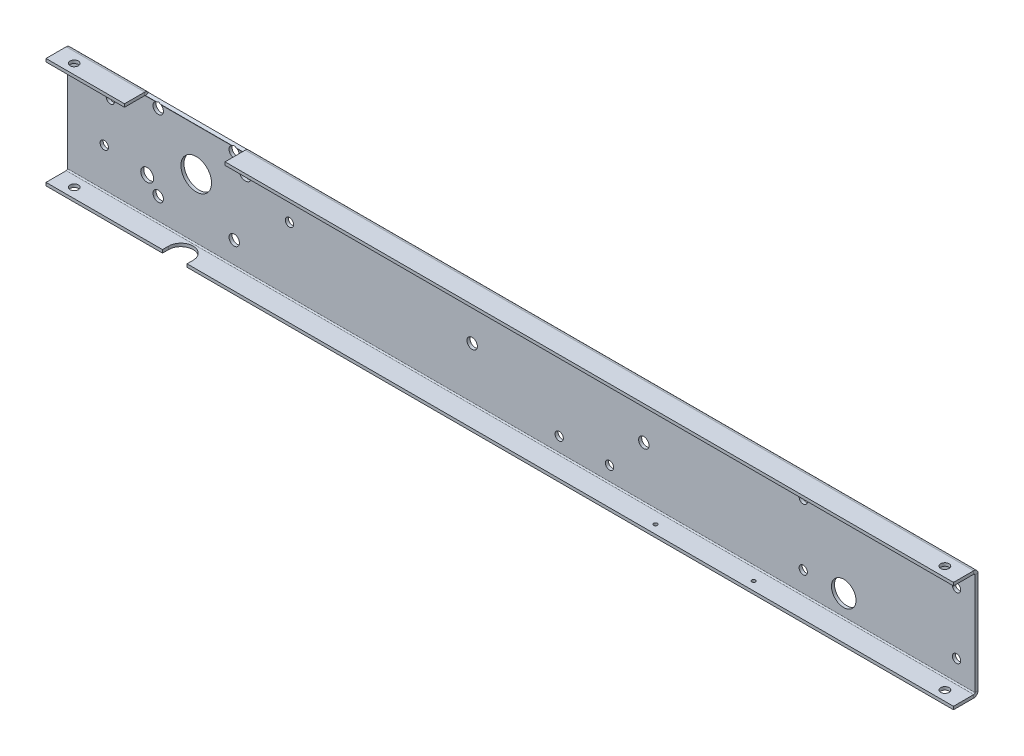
ISO-10303-21;
HEADER;
FILE_DESCRIPTION(('STEP AP214'),'2;1');
FILE_NAME('part.step','',(''),(''),'','','');
FILE_SCHEMA(('AUTOMOTIVE_DESIGN { 1 0 10303 214 1 1 1 1 }'));
ENDSEC;
DATA;
#1=APPLICATION_CONTEXT('core data for automotive mechanical design processes');
#2=APPLICATION_PROTOCOL_DEFINITION('international standard','automotive_design',2000,#1);
#3=PRODUCT_CONTEXT('',#1,'mechanical');
#4=PRODUCT('Part','Part','',(#3));
#5=PRODUCT_RELATED_PRODUCT_CATEGORY('part','',(#4));
#6=PRODUCT_DEFINITION_FORMATION('','',#4);
#7=PRODUCT_DEFINITION_CONTEXT('part definition',#1,'design');
#8=PRODUCT_DEFINITION('design','',#6,#7);
#9=PRODUCT_DEFINITION_SHAPE('','',#8);
#10=(LENGTH_UNIT() NAMED_UNIT(*) SI_UNIT(.MILLI.,.METRE.));
#11=(NAMED_UNIT(*) PLANE_ANGLE_UNIT() SI_UNIT($,.RADIAN.));
#12=(NAMED_UNIT(*) SI_UNIT($,.STERADIAN.) SOLID_ANGLE_UNIT());
#13=UNCERTAINTY_MEASURE_WITH_UNIT(LENGTH_MEASURE(1.E-05),#10,'distance_accuracy_value','');
#14=(GEOMETRIC_REPRESENTATION_CONTEXT(3) GLOBAL_UNCERTAINTY_ASSIGNED_CONTEXT((#13)) GLOBAL_UNIT_ASSIGNED_CONTEXT((#10,
#11,#12)) REPRESENTATION_CONTEXT('',''));
#15=CARTESIAN_POINT('',(0.,0.,0.));
#16=DIRECTION('',(0.,0.,1.));
#17=DIRECTION('',(1.,0.,0.));
#18=AXIS2_PLACEMENT_3D('',#15,#16,#17);
#19=CARTESIAN_POINT('',(-740.,86.5,3.49999999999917));
#20=DIRECTION('',(1.,0.,0.));
#21=DIRECTION('',(0.,0.,1.));
#22=AXIS2_PLACEMENT_3D('',#19,#20,#21);
#23=CYLINDRICAL_SURFACE('',#22,1.);
#24=CARTESIAN_POINT('',(-668.410912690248,86.5,2.5));
#25=CARTESIAN_POINT('',(-668.343303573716,86.5465825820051,2.50003894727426));
#26=CARTESIAN_POINT('',(-668.27441602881,86.5911351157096,2.50324974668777));
#27=CARTESIAN_POINT('',(-668.134614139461,86.6759449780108,2.51466343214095));
#28=CARTESIAN_POINT('',(-668.063704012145,86.7162105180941,2.5228565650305));
#29=CARTESIAN_POINT('',(-667.919713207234,86.7926101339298,2.5429506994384));
#30=CARTESIAN_POINT('',(-667.846622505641,86.8287195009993,2.554872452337));
#31=CARTESIAN_POINT('',(-667.698838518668,86.8965446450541,2.5812627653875));
#32=CARTESIAN_POINT('',(-667.624144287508,86.9282577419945,2.59573286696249));
#33=CARTESIAN_POINT('',(-667.441127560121,86.9998761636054,2.63261069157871));
#34=CARTESIAN_POINT('',(-667.332060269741,87.0375001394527,2.65577011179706));
#35=CARTESIAN_POINT('',(-667.111137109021,87.1038011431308,2.70184400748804));
#36=CARTESIAN_POINT('',(-666.999279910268,87.1324738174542,2.72475835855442));
#37=CARTESIAN_POINT('',(-666.773776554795,87.1805443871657,2.76660542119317));
#38=CARTESIAN_POINT('',(-666.660151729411,87.2000143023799,2.78556837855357));
#39=CARTESIAN_POINT('',(-666.430736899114,87.2296928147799,2.81588326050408));
#40=CARTESIAN_POINT('',(-666.314949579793,87.2399122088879,2.82724405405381));
#41=CARTESIAN_POINT('',(-666.104787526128,87.2497475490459,2.83824561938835));
#42=CARTESIAN_POINT('',(-666.010588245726,87.2510279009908,2.83972363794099));
#43=CARTESIAN_POINT('',(-665.822460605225,87.2473323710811,2.83554374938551));
#44=CARTESIAN_POINT('',(-665.728532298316,87.2423553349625,2.82988452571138));
#45=CARTESIAN_POINT('',(-665.541126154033,87.226210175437,2.8124280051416));
#46=CARTESIAN_POINT('',(-665.447656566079,87.2149972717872,2.80058634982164));
#47=CARTESIAN_POINT('',(-665.262297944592,87.1865372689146,2.7726337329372));
#48=CARTESIAN_POINT('',(-665.170409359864,87.1692884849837,2.75652157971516));
#49=CARTESIAN_POINT('',(-664.964920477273,87.1236955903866,2.71762205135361));
#50=CARTESIAN_POINT('',(-664.851824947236,87.0936378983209,2.6941843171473));
#51=CARTESIAN_POINT('',(-664.628407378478,87.024291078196,2.6474324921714));
#52=CARTESIAN_POINT('',(-664.518086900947,86.984996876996,2.62411847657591));
#53=CARTESIAN_POINT('',(-664.301212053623,86.8974609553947,2.58109233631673));
#54=CARTESIAN_POINT('',(-664.194637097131,86.8492822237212,2.56135668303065));
#55=CARTESIAN_POINT('',(-663.985085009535,86.7438381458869,2.52861498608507));
#56=CARTESIAN_POINT('',(-663.882102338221,86.686587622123,2.51559810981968));
#57=CARTESIAN_POINT('',(-663.748886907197,86.6050588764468,2.50533235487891));
#58=CARTESIAN_POINT('',(-663.716586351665,86.5846872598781,2.50337410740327));
#59=CARTESIAN_POINT('',(-663.652457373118,86.5430223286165,2.5007074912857));
#60=CARTESIAN_POINT('',(-663.620629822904,86.5217275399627,2.50000120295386));
#61=CARTESIAN_POINT('',(-663.589087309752,86.4999999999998,2.49999999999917));
#62=B_SPLINE_CURVE_WITH_KNOTS('',3,(#24,#25,#26,#27,#28,#29,#30,#31,#32,#33,#34,#35,#36,#37,#38,
#39,#40,#41,#42,#43,#44,#45,#46,#47,#48,#49,#50,#51,#52,#53,#54,#55,#56,#57,#58,#59,#60,#61),
.UNSPECIFIED.,.F.,.F.,(4,2,2,2,2,2,2,2,2,2,2,2,2,2,2,2,2,2,4),(0.,0.246074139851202,
0.491668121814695,0.73865402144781,0.98578983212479,1.33841616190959,1.69121372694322,
2.04120265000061,2.39078254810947,2.67296686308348,2.95520323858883,3.23949304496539,
3.52386226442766,3.88148704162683,4.2393087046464,4.59468478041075,4.94948608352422,
5.06417232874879,5.17904896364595),.UNSPECIFIED.);
#63=CARTESIAN_POINT('',(-668.410912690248,86.5,2.5));
#64=VERTEX_POINT('',#63);
#65=CARTESIAN_POINT('',(-667.436140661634,87.,2.63397459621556));
#66=VERTEX_POINT('',#65);
#67=EDGE_CURVE('E430',#64,#66,#62,.T.);
#68=ORIENTED_EDGE('',*,*,#67,.T.);
#69=DIRECTION('',(1.,0.,0.));
#70=VECTOR('',#69,1.);
#71=CARTESIAN_POINT('',(-740.,87.,2.63397459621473));
#72=LINE('',#71,#70);
#73=CARTESIAN_POINT('',(-676.,87.0000000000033,2.63397459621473));
#74=VERTEX_POINT('',#73);
#75=EDGE_CURVE('E512',#66,#74,#72,.F.);
#76=ORIENTED_EDGE('',*,*,#75,.T.);
#77=CARTESIAN_POINT('',(-676.,86.5000000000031,3.49999999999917));
#78=DIRECTION('',(-1.,0.,0.));
#79=DIRECTION('',(0.,0.,1.));
#80=AXIS2_PLACEMENT_3D('',#77,#78,#79);
#81=CIRCLE('',#80,1.);
#82=CARTESIAN_POINT('',(-676.,87.5000000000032,3.49999999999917));
#83=VERTEX_POINT('',#82);
#84=EDGE_CURVE('E570',#74,#83,#81,.F.);
#85=ORIENTED_EDGE('',*,*,#84,.T.);
#86=DIRECTION('',(1.,0.,0.));
#87=VECTOR('',#86,1.);
#88=CARTESIAN_POINT('',(-740.,87.4999999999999,3.49999999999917));
#89=LINE('',#88,#87);
#90=CARTESIAN_POINT('',(-740.,87.4999999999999,3.49999999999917));
#91=VERTEX_POINT('',#90);
#92=EDGE_CURVE('E651',#91,#83,#89,.T.);
#93=ORIENTED_EDGE('',*,*,#92,.F.);
#94=CARTESIAN_POINT('',(-740.,86.5,3.49999999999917));
#95=DIRECTION('',(-1.,0.,0.));
#96=DIRECTION('',(0.,0.,1.));
#97=AXIS2_PLACEMENT_3D('',#94,#95,#96);
#98=CIRCLE('',#97,1.);
#99=CARTESIAN_POINT('',(-740.,86.5,2.49999999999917));
#100=VERTEX_POINT('',#99);
#101=EDGE_CURVE('E646',#100,#91,#98,.F.);
#102=ORIENTED_EDGE('',*,*,#101,.F.);
#103=DIRECTION('',(1.,0.,0.));
#104=VECTOR('',#103,1.);
#105=CARTESIAN_POINT('',(-740.,86.5,2.49999999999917));
#106=LINE('',#105,#104);
#107=EDGE_CURVE('E514',#100,#64,#106,.T.);
#108=ORIENTED_EDGE('',*,*,#107,.T.);
#109=EDGE_LOOP('',(#68,#76,#85,#93,#102,#108));
#110=FACE_BOUND('',#109,.T.);
#111=ADVANCED_FACE('F42',(#110),#23,.F.);
#112=CARTESIAN_POINT('',(-664.563859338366,87.,2.63397459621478));
#113=VERTEX_POINT('',#112);
#114=CARTESIAN_POINT('',(-663.589087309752,86.5,2.49999999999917));
#115=VERTEX_POINT('',#114);
#116=EDGE_CURVE('E421',#113,#115,#62,.T.);
#117=ORIENTED_EDGE('',*,*,#116,.T.);
#118=CARTESIAN_POINT('',(-606.410912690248,86.5,2.5));
#119=VERTEX_POINT('',#118);
#120=EDGE_CURVE('E659',#115,#119,#106,.T.);
#121=ORIENTED_EDGE('',*,*,#120,.T.);
#122=CARTESIAN_POINT('',(-606.410912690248,86.5,2.5));
#123=CARTESIAN_POINT('',(-606.343303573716,86.5465825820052,2.50003894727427));
#124=CARTESIAN_POINT('',(-606.27441602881,86.5911351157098,2.50324974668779));
#125=CARTESIAN_POINT('',(-606.134614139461,86.675944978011,2.51466343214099));
#126=CARTESIAN_POINT('',(-606.063704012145,86.7162105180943,2.52285656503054));
#127=CARTESIAN_POINT('',(-605.919713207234,86.79261013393,2.54295069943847));
#128=CARTESIAN_POINT('',(-605.846622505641,86.8287195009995,2.5548724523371));
#129=CARTESIAN_POINT('',(-605.698838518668,86.8965446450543,2.58126276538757));
#130=CARTESIAN_POINT('',(-605.624144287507,86.9282577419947,2.5957328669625));
#131=CARTESIAN_POINT('',(-605.441127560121,86.9998761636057,2.6326106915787));
#132=CARTESIAN_POINT('',(-605.332060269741,87.0375001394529,2.65577011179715));
#133=CARTESIAN_POINT('',(-605.111137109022,87.103801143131,2.7018440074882));
#134=CARTESIAN_POINT('',(-604.999279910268,87.1324738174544,2.72475835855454));
#135=CARTESIAN_POINT('',(-604.773776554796,87.1805443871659,2.76660542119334));
#136=CARTESIAN_POINT('',(-604.660151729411,87.2000143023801,2.78556837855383));
#137=CARTESIAN_POINT('',(-604.430736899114,87.2296928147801,2.81588326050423));
#138=CARTESIAN_POINT('',(-604.314949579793,87.2399122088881,2.82724405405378));
#139=CARTESIAN_POINT('',(-604.104787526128,87.2497475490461,2.83824561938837));
#140=CARTESIAN_POINT('',(-604.010588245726,87.2510279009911,2.83972363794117));
#141=CARTESIAN_POINT('',(-603.822460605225,87.2473323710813,2.83554374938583));
#142=CARTESIAN_POINT('',(-603.728532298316,87.2423553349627,2.82988452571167));
#143=CARTESIAN_POINT('',(-603.541126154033,87.2262101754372,2.81242800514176));
#144=CARTESIAN_POINT('',(-603.447656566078,87.2149972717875,2.8005863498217));
#145=CARTESIAN_POINT('',(-603.262297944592,87.1865372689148,2.77263373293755));
#146=CARTESIAN_POINT('',(-603.170409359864,87.1692884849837,2.75652157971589));
#147=CARTESIAN_POINT('',(-602.964920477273,87.1236955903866,2.71762205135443));
#148=CARTESIAN_POINT('',(-602.851824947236,87.0936378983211,2.69418431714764));
#149=CARTESIAN_POINT('',(-602.628407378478,87.0242910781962,2.64743249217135));
#150=CARTESIAN_POINT('',(-602.518086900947,86.9849968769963,2.62411847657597));
#151=CARTESIAN_POINT('',(-602.301212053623,86.8974609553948,2.58109233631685));
#152=CARTESIAN_POINT('',(-602.194637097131,86.8492822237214,2.56135668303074));
#153=CARTESIAN_POINT('',(-601.985085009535,86.7438381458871,2.52861498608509));
#154=CARTESIAN_POINT('',(-601.882102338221,86.6865876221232,2.51559810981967));
#155=CARTESIAN_POINT('',(-601.748886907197,86.605058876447,2.50533235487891));
#156=CARTESIAN_POINT('',(-601.716586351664,86.5846872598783,2.50337410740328));
#157=CARTESIAN_POINT('',(-601.652457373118,86.5430223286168,2.50070749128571));
#158=CARTESIAN_POINT('',(-601.620629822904,86.5217275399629,2.50000120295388));
#159=CARTESIAN_POINT('',(-601.589087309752,86.5,2.49999999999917));
#160=B_SPLINE_CURVE_WITH_KNOTS('',3,(#122,#123,#124,#125,#126,#127,#128,#129,#130,#131,#132,
#133,#134,#135,#136,#137,#138,#139,#140,#141,#142,#143,#144,#145,#146,#147,#148,#149,#150,#151,
#152,#153,#154,#155,#156,#157,#158,#159),.UNSPECIFIED.,.F.,.F.,(4,2,2,2,2,2,2,2,2,2,2,2,2,2,2,2,
2,2,4),(0.,0.246074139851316,0.491668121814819,0.738654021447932,0.985789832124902,
1.33841616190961,1.69121372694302,2.04120265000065,2.3907825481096,2.6729668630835,
2.95520323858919,3.23949304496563,3.52386226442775,3.88148704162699,4.23930870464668,
4.59468478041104,4.9494860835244,5.06417232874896,5.17904896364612),.UNSPECIFIED.);
#161=CARTESIAN_POINT('',(-605.436140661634,87.0000000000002,2.63397459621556));
#162=VERTEX_POINT('',#161);
#163=EDGE_CURVE('E460',#119,#162,#160,.T.);
#164=ORIENTED_EDGE('',*,*,#163,.T.);
#165=EDGE_CURVE('E530',#162,#113,#72,.F.);
#166=ORIENTED_EDGE('',*,*,#165,.T.);
#167=EDGE_LOOP('',(#117,#121,#164,#166));
#168=FACE_BOUND('',#167,.T.);
#169=ADVANCED_FACE('F445',(#168),#23,.F.);
#170=CARTESIAN_POINT('',(-740.,87.4999999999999,-8.32667268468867E-13));
#171=DIRECTION('',(0.,-1.,0.));
#172=DIRECTION('',(0.,0.,1.));
#173=AXIS2_PLACEMENT_3D('',#170,#171,#172);
#174=PLANE('',#173);
#175=CARTESIAN_POINT('',(-725.000000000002,87.5000000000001,11.9999999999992));
#176=DIRECTION('',(0.,1.,0.));
#177=DIRECTION('',(0.,0.,1.));
#178=AXIS2_PLACEMENT_3D('',#175,#176,#177);
#179=CIRCLE('',#178,3.39999999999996);
#180=CARTESIAN_POINT('',(-725.000000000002,87.5000000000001,15.3999999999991));
#181=VERTEX_POINT('',#180);
#182=EDGE_CURVE('E936',#181,#181,#179,.T.);
#183=ORIENTED_EDGE('',*,*,#182,.T.);
#184=EDGE_LOOP('',(#183));
#185=FACE_BOUND('',#184,.T.);
#186=DIRECTION('',(1.,0.,0.));
#187=VECTOR('',#186,1.);
#188=CARTESIAN_POINT('',(-740.,87.4999999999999,19.9999999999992));
#189=LINE('',#188,#187);
#190=CARTESIAN_POINT('',(-740.,87.4999999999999,19.9999999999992));
#191=VERTEX_POINT('',#190);
#192=CARTESIAN_POINT('',(-676.,87.5000000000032,19.9999999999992));
#193=VERTEX_POINT('',#192);
#194=EDGE_CURVE('E677',#191,#193,#189,.T.);
#195=ORIENTED_EDGE('',*,*,#194,.F.);
#196=DIRECTION('',(0.,0.,1.));
#197=VECTOR('',#196,1.);
#198=CARTESIAN_POINT('',(-740.,87.4999999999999,-8.32667268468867E-13));
#199=LINE('',#198,#197);
#200=EDGE_CURVE('E626',#91,#191,#199,.T.);
#201=ORIENTED_EDGE('',*,*,#200,.F.);
#202=ORIENTED_EDGE('',*,*,#92,.T.);
#203=DIRECTION('',(0.,0.,1.));
#204=VECTOR('',#203,1.);
#205=CARTESIAN_POINT('',(-676.,87.5000000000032,-8.32667268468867E-13));
#206=LINE('',#205,#204);
#207=EDGE_CURVE('E577',#83,#193,#206,.T.);
#208=ORIENTED_EDGE('',*,*,#207,.T.);
#209=EDGE_LOOP('',(#195,#201,#202,#208));
#210=FACE_BOUND('',#209,.T.);
#211=ADVANCED_FACE('F763',(#185,#210),#174,.T.);
#212=CARTESIAN_POINT('',(-14.9999999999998,87.4999999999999,11.9999999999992));
#213=DIRECTION('',(0.,1.,0.));
#214=DIRECTION('',(0.,0.,1.));
#215=AXIS2_PLACEMENT_3D('',#212,#213,#214);
#216=CIRCLE('',#215,3.39999999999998);
#217=CARTESIAN_POINT('',(-14.9999999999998,87.4999999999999,15.3999999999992));
#218=VERTEX_POINT('',#217);
#219=EDGE_CURVE('E531',#218,#218,#216,.T.);
#220=ORIENTED_EDGE('',*,*,#219,.T.);
#221=EDGE_LOOP('',(#220));
#222=FACE_BOUND('',#221,.T.);
#223=CARTESIAN_POINT('',(-594.,87.5000000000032,3.5));
#224=VERTEX_POINT('',#223);
#225=CARTESIAN_POINT('',(2.08166817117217E-13,87.4999999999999,3.49999999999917));
#226=VERTEX_POINT('',#225);
#227=EDGE_CURVE('E656',#224,#226,#89,.T.);
#228=ORIENTED_EDGE('',*,*,#227,.T.);
#229=DIRECTION('',(0.,0.,1.));
#230=VECTOR('',#229,1.);
#231=CARTESIAN_POINT('',(2.08166817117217E-13,87.4999999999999,-8.32667268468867E-13));
#232=LINE('',#231,#230);
#233=CARTESIAN_POINT('',(2.08166817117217E-13,87.4999999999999,19.9999999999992));
#234=VERTEX_POINT('',#233);
#235=EDGE_CURVE('E598',#226,#234,#232,.T.);
#236=ORIENTED_EDGE('',*,*,#235,.T.);
#237=CARTESIAN_POINT('',(-594.,87.5000000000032,20.));
#238=VERTEX_POINT('',#237);
#239=EDGE_CURVE('E650',#238,#234,#189,.T.);
#240=ORIENTED_EDGE('',*,*,#239,.F.);
#241=DIRECTION('',(0.,0.,-1.));
#242=VECTOR('',#241,1.);
#243=CARTESIAN_POINT('',(-594.,87.5000000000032,-9.43689570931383E-13));
#244=LINE('',#243,#242);
#245=EDGE_CURVE('E573',#238,#224,#244,.T.);
#246=ORIENTED_EDGE('',*,*,#245,.T.);
#247=EDGE_LOOP('',(#228,#236,#240,#246));
#248=FACE_BOUND('',#247,.T.);
#249=ADVANCED_FACE('F443',(#222,#248),#174,.T.);
#250=CARTESIAN_POINT('',(-602.563859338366,87.0000000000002,2.63397459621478));
#251=VERTEX_POINT('',#250);
#252=CARTESIAN_POINT('',(-601.589087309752,86.5,2.49999999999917));
#253=VERTEX_POINT('',#252);
#254=EDGE_CURVE('E452',#251,#253,#160,.T.);
#255=ORIENTED_EDGE('',*,*,#254,.T.);
#256=CARTESIAN_POINT('',(2.08166817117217E-13,86.5,2.49999999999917));
#257=VERTEX_POINT('',#256);
#258=EDGE_CURVE('E660',#253,#257,#106,.T.);
#259=ORIENTED_EDGE('',*,*,#258,.T.);
#260=CARTESIAN_POINT('',(2.08166817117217E-13,86.5,3.49999999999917));
#261=DIRECTION('',(-1.,0.,0.));
#262=DIRECTION('',(0.,0.,1.));
#263=AXIS2_PLACEMENT_3D('',#260,#261,#262);
#264=CIRCLE('',#263,1.);
#265=EDGE_CURVE('E622',#257,#226,#264,.F.);
#266=ORIENTED_EDGE('',*,*,#265,.T.);
#267=ORIENTED_EDGE('',*,*,#227,.F.);
#268=CARTESIAN_POINT('',(-594.,86.5000000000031,3.5));
#269=DIRECTION('',(-1.,0.,0.));
#270=DIRECTION('',(0.,0.,1.));
#271=AXIS2_PLACEMENT_3D('',#268,#269,#270);
#272=CIRCLE('',#271,1.);
#273=CARTESIAN_POINT('',(-594.,87.0000000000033,2.63397459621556));
#274=VERTEX_POINT('',#273);
#275=EDGE_CURVE('E567',#224,#274,#272,.T.);
#276=ORIENTED_EDGE('',*,*,#275,.T.);
#277=EDGE_CURVE('E533',#274,#251,#72,.F.);
#278=ORIENTED_EDGE('',*,*,#277,.T.);
#279=EDGE_LOOP('',(#255,#259,#266,#267,#276,#278));
#280=FACE_BOUND('',#279,.T.);
#281=ADVANCED_FACE('F437',(#280),#23,.F.);
#282=CARTESIAN_POINT('',(-740.,86.5,3.49999999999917));
#283=DIRECTION('',(1.,0.,0.));
#284=DIRECTION('',(0.,0.,1.));
#285=AXIS2_PLACEMENT_3D('',#282,#283,#284);
#286=CYLINDRICAL_SURFACE('',#285,3.5);
#287=DIRECTION('',(1.,0.,0.));
#288=VECTOR('',#287,1.);
#289=CARTESIAN_POINT('',(-740.,86.4999999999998,-8.32667268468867E-13));
#290=LINE('',#289,#288);
#291=CARTESIAN_POINT('',(-740.,86.4999999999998,-8.32667268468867E-13));
#292=VERTEX_POINT('',#291);
#293=CARTESIAN_POINT('',(-668.410912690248,86.4999999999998,0.));
#294=VERTEX_POINT('',#293);
#295=EDGE_CURVE('E661',#292,#294,#290,.T.);
#296=ORIENTED_EDGE('',*,*,#295,.F.);
#297=CARTESIAN_POINT('',(-740.,86.5,3.49999999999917));
#298=DIRECTION('',(-1.,0.,0.));
#299=DIRECTION('',(0.,0.,1.));
#300=AXIS2_PLACEMENT_3D('',#297,#298,#299);
#301=CIRCLE('',#300,3.5);
#302=CARTESIAN_POINT('',(-739.999999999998,90.0000000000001,3.49999999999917));
#303=VERTEX_POINT('',#302);
#304=EDGE_CURVE('E636',#292,#303,#301,.F.);
#305=ORIENTED_EDGE('',*,*,#304,.T.);
#306=DIRECTION('',(1.,0.,0.));
#307=VECTOR('',#306,1.);
#308=CARTESIAN_POINT('',(-739.999999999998,90.0000000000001,3.49999999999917));
#309=LINE('',#308,#307);
#310=CARTESIAN_POINT('',(-675.999999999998,90.0000000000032,3.49999999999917));
#311=VERTEX_POINT('',#310);
#312=EDGE_CURVE('E667',#303,#311,#309,.T.);
#313=ORIENTED_EDGE('',*,*,#312,.T.);
#314=CARTESIAN_POINT('',(-676.,86.5000000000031,3.49999999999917));
#315=DIRECTION('',(1.,0.,0.));
#316=DIRECTION('',(0.,0.,-1.));
#317=AXIS2_PLACEMENT_3D('',#314,#315,#316);
#318=CIRCLE('',#317,3.5);
#319=CARTESIAN_POINT('',(-675.999999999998,88.2500000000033,0.468911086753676));
#320=VERTEX_POINT('',#319);
#321=EDGE_CURVE('E563',#320,#311,#318,.T.);
#322=ORIENTED_EDGE('',*,*,#321,.F.);
#323=DIRECTION('',(1.,0.,0.));
#324=VECTOR('',#323,1.);
#325=CARTESIAN_POINT('',(-739.999999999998,88.2499999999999,0.468911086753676));
#326=LINE('',#325,#324);
#327=CARTESIAN_POINT('',(-593.999999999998,88.2500000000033,0.468911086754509));
#328=VERTEX_POINT('',#327);
#329=EDGE_CURVE('E542',#328,#320,#326,.F.);
#330=ORIENTED_EDGE('',*,*,#329,.F.);
#331=CARTESIAN_POINT('',(-594.,86.5000000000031,3.5));
#332=DIRECTION('',(-1.,0.,0.));
#333=DIRECTION('',(0.,0.,1.));
#334=AXIS2_PLACEMENT_3D('',#331,#332,#333);
#335=CIRCLE('',#334,3.5);
#336=CARTESIAN_POINT('',(-593.999999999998,90.0000000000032,3.5));
#337=VERTEX_POINT('',#336);
#338=EDGE_CURVE('E559',#337,#328,#335,.T.);
#339=ORIENTED_EDGE('',*,*,#338,.F.);
#340=CARTESIAN_POINT('',(0.,90.0000000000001,3.49999999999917));
#341=VERTEX_POINT('',#340);
#342=EDGE_CURVE('E671',#337,#341,#309,.T.);
#343=ORIENTED_EDGE('',*,*,#342,.T.);
#344=CARTESIAN_POINT('',(2.08166817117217E-13,86.5,3.49999999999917));
#345=DIRECTION('',(-1.,0.,0.));
#346=DIRECTION('',(0.,0.,1.));
#347=AXIS2_PLACEMENT_3D('',#344,#345,#346);
#348=CIRCLE('',#347,3.5);
#349=CARTESIAN_POINT('',(2.08166817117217E-13,86.5,-8.32667268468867E-13));
#350=VERTEX_POINT('',#349);
#351=EDGE_CURVE('E611',#350,#341,#348,.F.);
#352=ORIENTED_EDGE('',*,*,#351,.F.);
#353=CARTESIAN_POINT('',(-601.589087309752,86.5,-8.32667268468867E-13));
#354=VERTEX_POINT('',#353);
#355=EDGE_CURVE('E666',#354,#350,#290,.T.);
#356=ORIENTED_EDGE('',*,*,#355,.F.);
#357=CARTESIAN_POINT('',(-606.410912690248,86.5,0.));
#358=CARTESIAN_POINT('',(-606.313119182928,86.5673785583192,2.11368626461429E-05));
#359=CARTESIAN_POINT('',(-606.212517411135,86.6306175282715,0.00194619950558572));
#360=CARTESIAN_POINT('',(-606.006468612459,86.7484174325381,0.00832329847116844));
#361=CARTESIAN_POINT('',(-605.901023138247,86.8029811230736,0.0127745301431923));
#362=CARTESIAN_POINT('',(-605.685965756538,86.9030886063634,0.0229261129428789));
#363=CARTESIAN_POINT('',(-605.576352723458,86.9486299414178,0.0286268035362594));
#364=CARTESIAN_POINT('',(-605.353703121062,87.0303908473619,0.0401742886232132));
#365=CARTESIAN_POINT('',(-605.240666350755,87.0666098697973,0.0460210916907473));
#366=CARTESIAN_POINT('',(-605.011916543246,87.1294788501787,0.0569236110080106));
#367=CARTESIAN_POINT('',(-604.896203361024,87.1561282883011,0.0619792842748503));
#368=CARTESIAN_POINT('',(-604.662899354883,87.1996600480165,0.0705730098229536));
#369=CARTESIAN_POINT('',(-604.545308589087,87.2165426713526,0.0741111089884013));
#370=CARTESIAN_POINT('',(-604.30917048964,87.2403991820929,0.0791874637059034));
#371=CARTESIAN_POINT('',(-604.190623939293,87.2473804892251,0.0807272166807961));
#372=CARTESIAN_POINT('',(-603.953356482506,87.2513999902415,0.0816081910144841));
#373=CARTESIAN_POINT('',(-603.834635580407,87.2484384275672,0.0809494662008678));
#374=CARTESIAN_POINT('',(-603.598922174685,87.2326667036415,0.0775355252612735));
#375=CARTESIAN_POINT('',(-603.481923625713,87.2199426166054,0.0747986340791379));
#376=CARTESIAN_POINT('',(-603.249429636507,87.1848497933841,0.0676100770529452));
#377=CARTESIAN_POINT('',(-603.133934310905,87.1624803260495,0.0631582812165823));
#378=CARTESIAN_POINT('',(-602.905230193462,87.1082587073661,0.0531492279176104));
#379=CARTESIAN_POINT('',(-602.79202157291,87.0764058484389,0.0475918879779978));
#380=CARTESIAN_POINT('',(-602.568684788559,87.0034536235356,0.0362022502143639));
#381=CARTESIAN_POINT('',(-602.458555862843,86.9623565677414,0.0303700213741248));
#382=CARTESIAN_POINT('',(-602.216708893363,86.860487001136,0.0181520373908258));
#383=CARTESIAN_POINT('',(-602.08595748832,86.7973609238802,0.0119552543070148));
#384=CARTESIAN_POINT('',(-601.895288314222,86.6929576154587,0.00515002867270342));
#385=CARTESIAN_POINT('',(-601.832689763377,86.6565706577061,0.00329710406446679));
#386=CARTESIAN_POINT('',(-601.709411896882,86.5806347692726,0.000723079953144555));
#387=CARTESIAN_POINT('',(-601.648732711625,86.5410856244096,2.05718470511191E-06));
#388=CARTESIAN_POINT('',(-601.589087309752,86.5,-8.32667268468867E-13));
#389=B_SPLINE_CURVE_WITH_KNOTS('',3,(#357,#358,#359,#360,#361,#362,#363,#364,#365,#366,#367,
#368,#369,#370,#371,#372,#373,#374,#375,#376,#377,#378,#379,#380,#381,#382,#383,#384,#385,#386,
#387,#388),.UNSPECIFIED.,.F.,.F.,(4,2,2,2,2,2,2,2,2,2,2,2,2,2,2,4),(0.,0.356104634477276,
0.71209590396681,1.06818401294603,1.42429306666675,1.78042146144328,2.13653885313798,
2.49238924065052,2.84823091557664,3.20097075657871,3.55373734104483,3.90653025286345,
4.25923509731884,4.69433457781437,4.91153502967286,5.12875020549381),.UNSPECIFIED.);
#390=CARTESIAN_POINT('',(-606.410912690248,86.5,0.));
#391=VERTEX_POINT('',#390);
#392=EDGE_CURVE('E472',#391,#354,#389,.T.);
#393=ORIENTED_EDGE('',*,*,#392,.F.);
#394=CARTESIAN_POINT('',(-663.589087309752,86.4999999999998,-8.32667268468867E-13));
#395=VERTEX_POINT('',#394);
#396=EDGE_CURVE('E665',#395,#391,#290,.T.);
#397=ORIENTED_EDGE('',*,*,#396,.F.);
#398=CARTESIAN_POINT('',(-668.410912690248,86.4999999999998,0.));
#399=CARTESIAN_POINT('',(-668.313119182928,86.567378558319,2.11368626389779E-05));
#400=CARTESIAN_POINT('',(-668.212517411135,86.6306175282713,0.0019461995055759));
#401=CARTESIAN_POINT('',(-668.006468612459,86.7484174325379,0.00832329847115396));
#402=CARTESIAN_POINT('',(-667.901023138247,86.8029811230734,0.0127745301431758));
#403=CARTESIAN_POINT('',(-667.685965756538,86.9030886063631,0.0229261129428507));
#404=CARTESIAN_POINT('',(-667.576352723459,86.9486299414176,0.0286268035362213));
#405=CARTESIAN_POINT('',(-667.353703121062,87.0303908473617,0.0401742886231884));
#406=CARTESIAN_POINT('',(-667.240666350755,87.0666098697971,0.0460210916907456));
#407=CARTESIAN_POINT('',(-667.011916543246,87.1294788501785,0.0569236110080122));
#408=CARTESIAN_POINT('',(-666.896203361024,87.1561282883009,0.0619792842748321));
#409=CARTESIAN_POINT('',(-666.662899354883,87.1996600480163,0.0705730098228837));
#410=CARTESIAN_POINT('',(-666.545308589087,87.2165426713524,0.0741111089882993));
#411=CARTESIAN_POINT('',(-666.30917048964,87.2403991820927,0.0791874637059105));
#412=CARTESIAN_POINT('',(-666.190623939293,87.2473804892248,0.0807272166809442));
#413=CARTESIAN_POINT('',(-665.953356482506,87.2513999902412,0.0816081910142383));
#414=CARTESIAN_POINT('',(-665.834635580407,87.248438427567,0.0809494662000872));
#415=CARTESIAN_POINT('',(-665.598922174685,87.2326667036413,0.0775355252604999));
#416=CARTESIAN_POINT('',(-665.481923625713,87.2199426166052,0.074798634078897));
#417=CARTESIAN_POINT('',(-665.249429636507,87.1848497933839,0.067610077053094));
#418=CARTESIAN_POINT('',(-665.133934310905,87.1624803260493,0.0631582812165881));
#419=CARTESIAN_POINT('',(-664.905230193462,87.1082587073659,0.0531492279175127));
#420=CARTESIAN_POINT('',(-664.79202157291,87.0764058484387,0.0475918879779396));
#421=CARTESIAN_POINT('',(-664.568684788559,87.0034536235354,0.0362022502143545));
#422=CARTESIAN_POINT('',(-664.458555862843,86.9623565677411,0.0303700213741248));
#423=CARTESIAN_POINT('',(-664.216708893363,86.8604870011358,0.0181520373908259));
#424=CARTESIAN_POINT('',(-664.08595748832,86.79736092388,0.0119552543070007));
#425=CARTESIAN_POINT('',(-663.895288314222,86.6929576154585,0.00515002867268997));
#426=CARTESIAN_POINT('',(-663.832689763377,86.6565706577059,0.00329710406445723));
#427=CARTESIAN_POINT('',(-663.709411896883,86.5806347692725,0.000723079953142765));
#428=CARTESIAN_POINT('',(-663.648732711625,86.5410856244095,2.05718470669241E-06));
#429=CARTESIAN_POINT('',(-663.589087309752,86.5,-8.32667268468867E-13));
#430=B_SPLINE_CURVE_WITH_KNOTS('',3,(#398,#399,#400,#401,#402,#403,#404,#405,#406,#407,#408,
#409,#410,#411,#412,#413,#414,#415,#416,#417,#418,#419,#420,#421,#422,#423,#424,#425,#426,#427,
#428,#429),.UNSPECIFIED.,.F.,.F.,(4,2,2,2,2,2,2,2,2,2,2,2,2,2,2,4),(0.,0.356104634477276,
0.712095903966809,1.06818401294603,1.42429306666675,1.78042146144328,2.13653885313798,
2.49238924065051,2.84823091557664,3.20097075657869,3.55373734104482,3.90653025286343,
4.25923509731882,4.69433457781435,4.91153502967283,5.12875020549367),.UNSPECIFIED.);
#431=EDGE_CURVE('E490',#294,#395,#430,.T.);
#432=ORIENTED_EDGE('',*,*,#431,.F.);
#433=EDGE_LOOP('',(#296,#305,#313,#322,#330,#339,#343,#352,#356,#393,#397,#432));
#434=FACE_BOUND('',#433,.T.);
#435=ADVANCED_FACE('F442',(#434),#286,.T.);
#436=CARTESIAN_POINT('',(-739.999999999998,90.0000000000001,-8.32667268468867E-13));
#437=DIRECTION('',(0.,-1.,0.));
#438=DIRECTION('',(0.,0.,1.));
#439=AXIS2_PLACEMENT_3D('',#436,#437,#438);
#440=PLANE('',#439);
#441=CARTESIAN_POINT('',(-725.,90.0000000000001,11.9999999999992));
#442=DIRECTION('',(0.,-1.,0.));
#443=DIRECTION('',(0.,0.,-1.));
#444=AXIS2_PLACEMENT_3D('',#441,#442,#443);
#445=CIRCLE('',#444,3.39999999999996);
#446=CARTESIAN_POINT('',(-725.,90.0000000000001,8.59999999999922));
#447=VERTEX_POINT('',#446);
#448=EDGE_CURVE('E939',#447,#447,#445,.T.);
#449=ORIENTED_EDGE('',*,*,#448,.T.);
#450=EDGE_LOOP('',(#449));
#451=FACE_BOUND('',#450,.T.);
#452=DIRECTION('',(0.,0.,1.));
#453=VECTOR('',#452,1.);
#454=CARTESIAN_POINT('',(-675.999999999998,90.0000000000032,-8.32667268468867E-13));
#455=LINE('',#454,#453);
#456=CARTESIAN_POINT('',(-675.999999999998,90.0000000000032,19.9999999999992));
#457=VERTEX_POINT('',#456);
#458=EDGE_CURVE('E581',#311,#457,#455,.T.);
#459=ORIENTED_EDGE('',*,*,#458,.F.);
#460=ORIENTED_EDGE('',*,*,#312,.F.);
#461=DIRECTION('',(0.,0.,1.));
#462=VECTOR('',#461,1.);
#463=CARTESIAN_POINT('',(-739.999999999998,90.0000000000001,-8.32667268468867E-13));
#464=LINE('',#463,#462);
#465=CARTESIAN_POINT('',(-739.999999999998,90.0000000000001,19.9999999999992));
#466=VERTEX_POINT('',#465);
#467=EDGE_CURVE('E632',#303,#466,#464,.T.);
#468=ORIENTED_EDGE('',*,*,#467,.T.);
#469=DIRECTION('',(1.,0.,0.));
#470=VECTOR('',#469,1.);
#471=CARTESIAN_POINT('',(-739.999999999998,90.0000000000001,19.9999999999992));
#472=LINE('',#471,#470);
#473=EDGE_CURVE('E672',#466,#457,#472,.T.);
#474=ORIENTED_EDGE('',*,*,#473,.T.);
#475=EDGE_LOOP('',(#459,#460,#468,#474));
#476=FACE_BOUND('',#475,.T.);
#477=ADVANCED_FACE('F485',(#451,#476),#440,.F.);
#478=CARTESIAN_POINT('',(-14.9999999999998,89.9999999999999,11.9999999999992));
#479=DIRECTION('',(0.,-1.,0.));
#480=DIRECTION('',(0.,0.,-1.));
#481=AXIS2_PLACEMENT_3D('',#478,#479,#480);
#482=CIRCLE('',#481,3.39999999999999);
#483=CARTESIAN_POINT('',(-14.9999999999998,89.9999999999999,8.59999999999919));
#484=VERTEX_POINT('',#483);
#485=EDGE_CURVE('E537',#484,#484,#482,.T.);
#486=ORIENTED_EDGE('',*,*,#485,.T.);
#487=EDGE_LOOP('',(#486));
#488=FACE_BOUND('',#487,.T.);
#489=DIRECTION('',(0.,0.,1.));
#490=VECTOR('',#489,1.);
#491=CARTESIAN_POINT('',(-593.999999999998,90.0000000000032,0.));
#492=LINE('',#491,#490);
#493=CARTESIAN_POINT('',(-593.999999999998,90.0000000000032,20.));
#494=VERTEX_POINT('',#493);
#495=EDGE_CURVE('E580',#494,#337,#492,.F.);
#496=ORIENTED_EDGE('',*,*,#495,.F.);
#497=CARTESIAN_POINT('',(0.,90.0000000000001,19.9999999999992));
#498=VERTEX_POINT('',#497);
#499=EDGE_CURVE('E676',#494,#498,#472,.T.);
#500=ORIENTED_EDGE('',*,*,#499,.T.);
#501=DIRECTION('',(0.,0.,1.));
#502=VECTOR('',#501,1.);
#503=CARTESIAN_POINT('',(0.,90.0000000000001,-8.32667268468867E-13));
#504=LINE('',#503,#502);
#505=EDGE_CURVE('E607',#341,#498,#504,.T.);
#506=ORIENTED_EDGE('',*,*,#505,.F.);
#507=ORIENTED_EDGE('',*,*,#342,.F.);
#508=EDGE_LOOP('',(#496,#500,#506,#507));
#509=FACE_BOUND('',#508,.T.);
#510=ADVANCED_FACE('F751',(#488,#509),#440,.F.);
#511=CARTESIAN_POINT('',(-739.999999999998,90.0000000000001,19.9999999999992));
#512=DIRECTION('',(0.,0.,-1.));
#513=DIRECTION('',(1.,0.,0.));
#514=AXIS2_PLACEMENT_3D('',#511,#512,#513);
#515=PLANE('',#514);
#516=DIRECTION('',(0.,-1.,0.));
#517=VECTOR('',#516,1.);
#518=CARTESIAN_POINT('',(-676.,87.5000000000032,19.9999999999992));
#519=LINE('',#518,#517);
#520=EDGE_CURVE('E589',#193,#457,#519,.F.);
#521=ORIENTED_EDGE('',*,*,#520,.T.);
#522=ORIENTED_EDGE('',*,*,#473,.F.);
#523=DIRECTION('',(0.,-1.,0.));
#524=VECTOR('',#523,1.);
#525=CARTESIAN_POINT('',(-739.999999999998,90.0000000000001,19.9999999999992));
#526=LINE('',#525,#524);
#527=EDGE_CURVE('E630',#466,#191,#526,.T.);
#528=ORIENTED_EDGE('',*,*,#527,.T.);
#529=ORIENTED_EDGE('',*,*,#194,.T.);
#530=EDGE_LOOP('',(#521,#522,#528,#529));
#531=FACE_BOUND('',#530,.T.);
#532=ADVANCED_FACE('F907',(#531),#515,.F.);
#533=DIRECTION('',(0.,-1.,0.));
#534=VECTOR('',#533,1.);
#535=CARTESIAN_POINT('',(-594.,87.5000000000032,20.));
#536=LINE('',#535,#534);
#537=EDGE_CURVE('E585',#238,#494,#536,.F.);
#538=ORIENTED_EDGE('',*,*,#537,.F.);
#539=ORIENTED_EDGE('',*,*,#239,.T.);
#540=DIRECTION('',(0.,-1.,0.));
#541=VECTOR('',#540,1.);
#542=CARTESIAN_POINT('',(0.,90.0000000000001,19.9999999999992));
#543=LINE('',#542,#541);
#544=EDGE_CURVE('E604',#498,#234,#543,.T.);
#545=ORIENTED_EDGE('',*,*,#544,.F.);
#546=ORIENTED_EDGE('',*,*,#499,.F.);
#547=EDGE_LOOP('',(#538,#539,#545,#546));
#548=FACE_BOUND('',#547,.T.);
#549=ADVANCED_FACE('F919',(#548),#515,.F.);
#550=CARTESIAN_POINT('',(0.,2.49999999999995,3.5));
#551=DIRECTION('',(1.,0.,0.));
#552=DIRECTION('',(0.,0.,1.));
#553=AXIS2_PLACEMENT_3D('',#550,#551,#552);
#554=PLANE('',#553);
#555=DIRECTION('',(0.,1.,0.));
#556=VECTOR('',#555,1.);
#557=CARTESIAN_POINT('',(2.08166817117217E-13,0.,0.));
#558=LINE('',#557,#556);
#559=CARTESIAN_POINT('',(0.,3.50000000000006,1.22496457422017E-09));
#560=VERTEX_POINT('',#559);
#561=EDGE_CURVE('E615',#560,#350,#558,.T.);
#562=ORIENTED_EDGE('',*,*,#561,.T.);
#563=DIRECTION('',(0.,0.,-1.));
#564=VECTOR('',#563,1.);
#565=CARTESIAN_POINT('',(2.08166817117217E-13,86.5,2.49999999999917));
#566=LINE('',#565,#564);
#567=EDGE_CURVE('E655',#257,#350,#566,.T.);
#568=ORIENTED_EDGE('',*,*,#567,.F.);
#569=DIRECTION('',(0.,1.,0.));
#570=VECTOR('',#569,1.);
#571=CARTESIAN_POINT('',(2.08166817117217E-13,0.,2.5));
#572=LINE('',#571,#570);
#573=CARTESIAN_POINT('',(0.,3.50000000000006,2.5));
#574=VERTEX_POINT('',#573);
#575=EDGE_CURVE('E619',#574,#257,#572,.T.);
#576=ORIENTED_EDGE('',*,*,#575,.F.);
#577=DIRECTION('',(0.,0.,1.));
#578=VECTOR('',#577,1.);
#579=CARTESIAN_POINT('',(0.,3.50000000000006,0.));
#580=LINE('',#579,#578);
#581=EDGE_CURVE('E11',#560,#574,#580,.T.);
#582=ORIENTED_EDGE('',*,*,#581,.F.);
#583=EDGE_LOOP('',(#562,#568,#576,#582));
#584=FACE_BOUND('',#583,.T.);
#585=ADVANCED_FACE('F716',(#584),#554,.T.);
#586=CARTESIAN_POINT('',(-740.,86.4999999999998,-8.32667268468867E-13));
#587=DIRECTION('',(-1.,0.,0.));
#588=DIRECTION('',(0.,0.,-1.));
#589=AXIS2_PLACEMENT_3D('',#586,#587,#588);
#590=PLANE('',#589);
#591=DIRECTION('',(0.,0.,1.));
#592=VECTOR('',#591,1.);
#593=CARTESIAN_POINT('',(-740.,86.4999999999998,-8.32667268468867E-13));
#594=LINE('',#593,#592);
#595=EDGE_CURVE('E689',#292,#100,#594,.T.);
#596=ORIENTED_EDGE('',*,*,#595,.T.);
#597=ORIENTED_EDGE('',*,*,#101,.T.);
#598=DIRECTION('',(0.,1.,0.));
#599=VECTOR('',#598,1.);
#600=CARTESIAN_POINT('',(-740.,87.4999999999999,3.49999999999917));
#601=LINE('',#600,#599);
#602=EDGE_CURVE('E686',#91,#303,#601,.T.);
#603=ORIENTED_EDGE('',*,*,#602,.T.);
#604=ORIENTED_EDGE('',*,*,#304,.F.);
#605=EDGE_LOOP('',(#596,#597,#603,#604));
#606=FACE_BOUND('',#605,.T.);
#607=ADVANCED_FACE('F766',(#606),#590,.T.);
#608=CARTESIAN_POINT('',(-740.,87.4999999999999,3.49999999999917));
#609=DIRECTION('',(-1.,0.,0.));
#610=DIRECTION('',(0.,0.,-1.));
#611=AXIS2_PLACEMENT_3D('',#608,#609,#610);
#612=PLANE('',#611);
#613=DIRECTION('',(0.,1.,0.));
#614=VECTOR('',#613,1.);
#615=CARTESIAN_POINT('',(-739.999999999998,0.,0.));
#616=LINE('',#615,#614);
#617=CARTESIAN_POINT('',(-739.999999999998,3.50000000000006,1.22496457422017E-09));
#618=VERTEX_POINT('',#617);
#619=EDGE_CURVE('E640',#618,#292,#616,.T.);
#620=ORIENTED_EDGE('',*,*,#619,.F.);
#621=DIRECTION('',(0.,0.,-1.));
#622=VECTOR('',#621,1.);
#623=CARTESIAN_POINT('',(-739.999999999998,3.50000000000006,2.5));
#624=LINE('',#623,#622);
#625=CARTESIAN_POINT('',(-739.999999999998,3.50000000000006,2.50000000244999));
#626=VERTEX_POINT('',#625);
#627=EDGE_CURVE('E698',#626,#618,#624,.T.);
#628=ORIENTED_EDGE('',*,*,#627,.F.);
#629=DIRECTION('',(0.,1.,0.));
#630=VECTOR('',#629,1.);
#631=CARTESIAN_POINT('',(-739.999999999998,0.,2.5));
#632=LINE('',#631,#630);
#633=EDGE_CURVE('E643',#626,#100,#632,.T.);
#634=ORIENTED_EDGE('',*,*,#633,.T.);
#635=ORIENTED_EDGE('',*,*,#595,.F.);
#636=EDGE_LOOP('',(#620,#628,#634,#635));
#637=FACE_BOUND('',#636,.T.);
#638=ADVANCED_FACE('F772',(#637),#612,.T.);
#639=CARTESIAN_POINT('',(0.,90.0000000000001,3.49999999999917));
#640=DIRECTION('',(1.,0.,0.));
#641=DIRECTION('',(0.,0.,1.));
#642=AXIS2_PLACEMENT_3D('',#639,#640,#641);
#643=PLANE('',#642);
#644=DIRECTION('',(0.,-1.,0.));
#645=VECTOR('',#644,1.);
#646=CARTESIAN_POINT('',(0.,90.0000000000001,3.49999999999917));
#647=LINE('',#646,#645);
#648=EDGE_CURVE('E683',#341,#226,#647,.T.);
#649=ORIENTED_EDGE('',*,*,#648,.T.);
#650=ORIENTED_EDGE('',*,*,#265,.F.);
#651=ORIENTED_EDGE('',*,*,#567,.T.);
#652=ORIENTED_EDGE('',*,*,#351,.T.);
#653=EDGE_LOOP('',(#649,#650,#651,#652));
#654=FACE_BOUND('',#653,.T.);
#655=ADVANCED_FACE('F721',(#654),#643,.T.);
#656=CARTESIAN_POINT('',(2.08166817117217E-13,86.5,2.49999999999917));
#657=DIRECTION('',(1.,0.,0.));
#658=DIRECTION('',(0.,0.,1.));
#659=AXIS2_PLACEMENT_3D('',#656,#657,#658);
#660=PLANE('',#659);
#661=ORIENTED_EDGE('',*,*,#505,.T.);
#662=ORIENTED_EDGE('',*,*,#544,.T.);
#663=ORIENTED_EDGE('',*,*,#235,.F.);
#664=ORIENTED_EDGE('',*,*,#648,.F.);
#665=EDGE_LOOP('',(#661,#662,#663,#664));
#666=FACE_BOUND('',#665,.T.);
#667=ADVANCED_FACE('F908',(#666),#660,.T.);
#668=CARTESIAN_POINT('',(-739.999999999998,0.,2.5));
#669=DIRECTION('',(0.,0.,1.));
#670=DIRECTION('',(-1.,0.,0.));
#671=AXIS2_PLACEMENT_3D('',#668,#669,#670);
#672=PLANE('',#671);
#673=CARTESIAN_POINT('',(-634.999999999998,52.,2.5));
#674=DIRECTION('',(0.,0.,-1.));
#675=DIRECTION('',(-1.,0.,0.));
#676=AXIS2_PLACEMENT_3D('',#673,#674,#675);
#677=CIRCLE('',#676,12.5);
#678=CARTESIAN_POINT('',(-647.499999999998,52.,2.5));
#679=VERTEX_POINT('',#678);
#680=EDGE_CURVE('E282',#679,#679,#677,.T.);
#681=ORIENTED_EDGE('',*,*,#680,.T.);
#682=EDGE_LOOP('',(#681));
#683=FACE_BOUND('',#682,.T.);
#684=CARTESIAN_POINT('',(-107.,20.,2.5));
#685=DIRECTION('',(0.,0.,-1.));
#686=DIRECTION('',(-1.,0.,0.));
#687=AXIS2_PLACEMENT_3D('',#684,#685,#686);
#688=CIRCLE('',#687,9.99999999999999);
#689=CARTESIAN_POINT('',(-117.,20.,2.5));
#690=VERTEX_POINT('',#689);
#691=EDGE_CURVE('E312',#690,#690,#688,.T.);
#692=ORIENTED_EDGE('',*,*,#691,.T.);
#693=EDGE_LOOP('',(#692));
#694=FACE_BOUND('',#693,.T.);
#695=CARTESIAN_POINT('',(-675.,31.4999999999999,2.49999999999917));
#696=DIRECTION('',(0.,0.,-1.));
#697=DIRECTION('',(-1.,0.,0.));
#698=AXIS2_PLACEMENT_3D('',#695,#696,#697);
#699=CIRCLE('',#698,5.24999999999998);
#700=CARTESIAN_POINT('',(-680.25,31.4999999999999,2.49999999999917));
#701=VERTEX_POINT('',#700);
#702=EDGE_CURVE('E320',#701,#701,#699,.T.);
#703=ORIENTED_EDGE('',*,*,#702,.T.);
#704=EDGE_LOOP('',(#703));
#705=FACE_BOUND('',#704,.T.);
#706=CARTESIAN_POINT('',(-594.999999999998,72.5000000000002,2.49999999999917));
#707=DIRECTION('',(0.,0.,-1.));
#708=DIRECTION('',(-1.,0.,0.));
#709=AXIS2_PLACEMENT_3D('',#706,#707,#708);
#710=CIRCLE('',#709,5.24999999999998);
#711=CARTESIAN_POINT('',(-600.249999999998,72.5000000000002,2.49999999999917));
#712=VERTEX_POINT('',#711);
#713=EDGE_CURVE('E328',#712,#712,#710,.T.);
#714=ORIENTED_EDGE('',*,*,#713,.T.);
#715=EDGE_LOOP('',(#714));
#716=FACE_BOUND('',#715,.T.);
#717=CARTESIAN_POINT('',(-559.,56.,2.5));
#718=DIRECTION('',(0.,0.,-1.));
#719=DIRECTION('',(-1.,0.,0.));
#720=AXIS2_PLACEMENT_3D('',#717,#718,#719);
#721=CIRCLE('',#720,3.39999999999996);
#722=CARTESIAN_POINT('',(-562.4,56.,2.5));
#723=VERTEX_POINT('',#722);
#724=EDGE_CURVE('E336',#723,#723,#721,.T.);
#725=ORIENTED_EDGE('',*,*,#724,.T.);
#726=EDGE_LOOP('',(#725));
#727=FACE_BOUND('',#726,.T.);
#728=CARTESIAN_POINT('',(-565.,75.,2.49999999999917));
#729=DIRECTION('',(0.,0.,-1.));
#730=DIRECTION('',(-1.,0.,0.));
#731=AXIS2_PLACEMENT_3D('',#728,#729,#730);
#732=CIRCLE('',#731,3.39999999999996);
#733=CARTESIAN_POINT('',(-568.4,75.,2.49999999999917));
#734=VERTEX_POINT('',#733);
#735=EDGE_CURVE('E344',#734,#734,#732,.T.);
#736=ORIENTED_EDGE('',*,*,#735,.T.);
#737=EDGE_LOOP('',(#736));
#738=FACE_BOUND('',#737,.T.);
#739=CARTESIAN_POINT('',(-704.999999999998,70.0000000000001,2.49999999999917));
#740=DIRECTION('',(0.,0.,-1.));
#741=DIRECTION('',(-1.,0.,0.));
#742=AXIS2_PLACEMENT_3D('',#739,#740,#741);
#743=CIRCLE('',#742,3.39999999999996);
#744=CARTESIAN_POINT('',(-708.399999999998,70.0000000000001,2.49999999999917));
#745=VERTEX_POINT('',#744);
#746=EDGE_CURVE('E352',#745,#745,#743,.T.);
#747=ORIENTED_EDGE('',*,*,#746,.T.);
#748=EDGE_LOOP('',(#747));
#749=FACE_BOUND('',#748,.T.);
#750=CARTESIAN_POINT('',(-710.,35.0000000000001,2.5));
#751=DIRECTION('',(0.,0.,-1.));
#752=DIRECTION('',(-1.,0.,0.));
#753=AXIS2_PLACEMENT_3D('',#750,#751,#752);
#754=CIRCLE('',#753,3.39999999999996);
#755=CARTESIAN_POINT('',(-713.4,35.0000000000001,2.5));
#756=VERTEX_POINT('',#755);
#757=EDGE_CURVE('E360',#756,#756,#754,.T.);
#758=ORIENTED_EDGE('',*,*,#757,.T.);
#759=EDGE_LOOP('',(#758));
#760=FACE_BOUND('',#759,.T.);
#761=CARTESIAN_POINT('',(-339.,15.0000000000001,2.49999999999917));
#762=DIRECTION('',(0.,0.,-1.));
#763=DIRECTION('',(-1.,0.,0.));
#764=AXIS2_PLACEMENT_3D('',#761,#762,#763);
#765=CIRCLE('',#764,3.40000000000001);
#766=CARTESIAN_POINT('',(-342.4,15.0000000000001,2.49999999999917));
#767=VERTEX_POINT('',#766);
#768=EDGE_CURVE('E367',#767,#767,#765,.T.);
#769=ORIENTED_EDGE('',*,*,#768,.T.);
#770=EDGE_LOOP('',(#769));
#771=FACE_BOUND('',#770,.T.);
#772=CARTESIAN_POINT('',(-297.999999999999,14.9999999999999,2.5));
#773=DIRECTION('',(0.,0.,-1.));
#774=DIRECTION('',(-1.,0.,0.));
#775=AXIS2_PLACEMENT_3D('',#772,#773,#774);
#776=CIRCLE('',#775,3.40000000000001);
#777=CARTESIAN_POINT('',(-301.399999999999,14.9999999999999,2.5));
#778=VERTEX_POINT('',#777);
#779=EDGE_CURVE('E375',#778,#778,#776,.T.);
#780=ORIENTED_EDGE('',*,*,#779,.T.);
#781=EDGE_LOOP('',(#780));
#782=FACE_BOUND('',#781,.T.);
#783=CARTESIAN_POINT('',(-140.,70.0000000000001,2.49999999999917));
#784=DIRECTION('',(0.,0.,-1.));
#785=DIRECTION('',(-1.,0.,0.));
#786=AXIS2_PLACEMENT_3D('',#783,#784,#785);
#787=CIRCLE('',#786,3.39999999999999);
#788=CARTESIAN_POINT('',(-143.4,70.0000000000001,2.49999999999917));
#789=VERTEX_POINT('',#788);
#790=EDGE_CURVE('E383',#789,#789,#787,.T.);
#791=ORIENTED_EDGE('',*,*,#790,.T.);
#792=EDGE_LOOP('',(#791));
#793=FACE_BOUND('',#792,.T.);
#794=CARTESIAN_POINT('',(-140.,20.,2.5));
#795=DIRECTION('',(0.,0.,-1.));
#796=DIRECTION('',(-1.,0.,0.));
#797=AXIS2_PLACEMENT_3D('',#794,#795,#796);
#798=CIRCLE('',#797,3.39999999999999);
#799=CARTESIAN_POINT('',(-143.4,20.,2.5));
#800=VERTEX_POINT('',#799);
#801=EDGE_CURVE('E391',#800,#800,#798,.T.);
#802=ORIENTED_EDGE('',*,*,#801,.T.);
#803=EDGE_LOOP('',(#802));
#804=FACE_BOUND('',#803,.T.);
#805=CARTESIAN_POINT('',(-15.,70.0000000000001,2.49999999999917));
#806=DIRECTION('',(0.,0.,-1.));
#807=DIRECTION('',(-1.,0.,0.));
#808=AXIS2_PLACEMENT_3D('',#805,#806,#807);
#809=CIRCLE('',#808,3.4);
#810=CARTESIAN_POINT('',(-18.4,70.0000000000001,2.49999999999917));
#811=VERTEX_POINT('',#810);
#812=EDGE_CURVE('E399',#811,#811,#809,.T.);
#813=ORIENTED_EDGE('',*,*,#812,.T.);
#814=EDGE_LOOP('',(#813));
#815=FACE_BOUND('',#814,.T.);
#816=CARTESIAN_POINT('',(-15.,20.,2.5));
#817=DIRECTION('',(0.,0.,-1.));
#818=DIRECTION('',(-1.,0.,0.));
#819=AXIS2_PLACEMENT_3D('',#816,#817,#818);
#820=CIRCLE('',#819,3.4);
#821=CARTESIAN_POINT('',(-18.4,20.,2.5));
#822=VERTEX_POINT('',#821);
#823=EDGE_CURVE('E407',#822,#822,#820,.T.);
#824=ORIENTED_EDGE('',*,*,#823,.T.);
#825=EDGE_LOOP('',(#824));
#826=FACE_BOUND('',#825,.T.);
#827=CARTESIAN_POINT('',(-270.,44.9999999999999,2.5));
#828=DIRECTION('',(0.,0.,-1.));
#829=DIRECTION('',(-1.,0.,0.));
#830=AXIS2_PLACEMENT_3D('',#827,#828,#829);
#831=CIRCLE('',#830,4.24999999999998);
#832=CARTESIAN_POINT('',(-274.25,44.9999999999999,2.5));
#833=VERTEX_POINT('',#832);
#834=EDGE_CURVE('E415',#833,#833,#831,.T.);
#835=ORIENTED_EDGE('',*,*,#834,.T.);
#836=EDGE_LOOP('',(#835));
#837=FACE_BOUND('',#836,.T.);
#838=CARTESIAN_POINT('',(-666.,83.,2.49999999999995));
#839=DIRECTION('',(0.,0.,-1.));
#840=DIRECTION('',(-1.,0.,0.));
#841=AXIS2_PLACEMENT_3D('',#838,#839,#840);
#842=CIRCLE('',#841,4.24999999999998);
#843=EDGE_CURVE('E431',#115,#64,#842,.T.);
#844=ORIENTED_EDGE('',*,*,#843,.T.);
#845=ORIENTED_EDGE('',*,*,#107,.F.);
#846=ORIENTED_EDGE('',*,*,#633,.F.);
#847=DIRECTION('',(1.,0.,0.));
#848=VECTOR('',#847,1.);
#849=CARTESIAN_POINT('',(-739.999999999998,3.50000000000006,2.5));
#850=LINE('',#849,#848);
#851=EDGE_CURVE('E52',#626,#574,#850,.T.);
#852=ORIENTED_EDGE('',*,*,#851,.T.);
#853=ORIENTED_EDGE('',*,*,#575,.T.);
#854=ORIENTED_EDGE('',*,*,#258,.F.);
#855=CARTESIAN_POINT('',(-604.,83.0000000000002,2.5));
#856=DIRECTION('',(0.,0.,-1.));
#857=DIRECTION('',(-1.,0.,0.));
#858=AXIS2_PLACEMENT_3D('',#855,#856,#857);
#859=CIRCLE('',#858,4.24999999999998);
#860=EDGE_CURVE('E462',#253,#119,#859,.T.);
#861=ORIENTED_EDGE('',*,*,#860,.T.);
#862=ORIENTED_EDGE('',*,*,#120,.F.);
#863=EDGE_LOOP('',(#844,#845,#846,#852,#853,#854,#861,#862));
#864=FACE_BOUND('',#863,.T.);
#865=CARTESIAN_POINT('',(-410.,45.0000000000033,2.5));
#866=DIRECTION('',(0.,0.,-1.));
#867=DIRECTION('',(-1.,0.,0.));
#868=AXIS2_PLACEMENT_3D('',#865,#866,#867);
#869=CIRCLE('',#868,4.24999999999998);
#870=CARTESIAN_POINT('',(-414.25,45.0000000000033,2.5));
#871=VERTEX_POINT('',#870);
#872=EDGE_CURVE('E959',#871,#871,#869,.T.);
#873=ORIENTED_EDGE('',*,*,#872,.T.);
#874=EDGE_LOOP('',(#873));
#875=FACE_BOUND('',#874,.T.);
#876=CARTESIAN_POINT('',(-665.999999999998,20.9999999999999,2.5));
#877=DIRECTION('',(0.,0.,-1.));
#878=DIRECTION('',(-1.,0.,0.));
#879=AXIS2_PLACEMENT_3D('',#876,#877,#878);
#880=CIRCLE('',#879,4.24999999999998);
#881=CARTESIAN_POINT('',(-670.249999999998,20.9999999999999,2.5));
#882=VERTEX_POINT('',#881);
#883=EDGE_CURVE('E952',#882,#882,#880,.T.);
#884=ORIENTED_EDGE('',*,*,#883,.T.);
#885=EDGE_LOOP('',(#884));
#886=FACE_BOUND('',#885,.T.);
#887=CARTESIAN_POINT('',(-603.999999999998,21.0000000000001,2.49999999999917));
#888=DIRECTION('',(0.,0.,-1.));
#889=DIRECTION('',(-1.,0.,0.));
#890=AXIS2_PLACEMENT_3D('',#887,#888,#889);
#891=CIRCLE('',#890,4.24999999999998);
#892=CARTESIAN_POINT('',(-608.249999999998,21.0000000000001,2.49999999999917));
#893=VERTEX_POINT('',#892);
#894=EDGE_CURVE('E945',#893,#893,#891,.T.);
#895=ORIENTED_EDGE('',*,*,#894,.T.);
#896=EDGE_LOOP('',(#895));
#897=FACE_BOUND('',#896,.T.);
#898=ADVANCED_FACE('F448',(#683,#694,#705,#716,#727,#738,#749,#760,#771,#782,#793,#804,#815,
#826,#837,#864,#875,#886,#897),#672,.T.);
#899=CARTESIAN_POINT('',(-739.999999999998,0.,0.));
#900=DIRECTION('',(0.,0.,1.));
#901=DIRECTION('',(-1.,0.,0.));
#902=AXIS2_PLACEMENT_3D('',#899,#900,#901);
#903=PLANE('',#902);
#904=CARTESIAN_POINT('',(-634.999999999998,52.,0.));
#905=DIRECTION('',(0.,0.,1.));
#906=DIRECTION('',(1.,0.,0.));
#907=AXIS2_PLACEMENT_3D('',#904,#905,#906);
#908=CIRCLE('',#907,12.5);
#909=CARTESIAN_POINT('',(-622.499999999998,52.,0.));
#910=VERTEX_POINT('',#909);
#911=EDGE_CURVE('E291',#910,#910,#908,.T.);
#912=ORIENTED_EDGE('',*,*,#911,.T.);
#913=EDGE_LOOP('',(#912));
#914=FACE_BOUND('',#913,.T.);
#915=CARTESIAN_POINT('',(-107.,20.,0.));
#916=DIRECTION('',(0.,0.,1.));
#917=DIRECTION('',(1.,0.,0.));
#918=AXIS2_PLACEMENT_3D('',#915,#916,#917);
#919=CIRCLE('',#918,9.99999999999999);
#920=CARTESIAN_POINT('',(-96.9999999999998,20.,0.));
#921=VERTEX_POINT('',#920);
#922=EDGE_CURVE('E308',#921,#921,#919,.T.);
#923=ORIENTED_EDGE('',*,*,#922,.T.);
#924=EDGE_LOOP('',(#923));
#925=FACE_BOUND('',#924,.T.);
#926=CARTESIAN_POINT('',(-675.,31.4999999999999,-8.32667268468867E-13));
#927=DIRECTION('',(0.,0.,1.));
#928=DIRECTION('',(1.,0.,0.));
#929=AXIS2_PLACEMENT_3D('',#926,#927,#928);
#930=CIRCLE('',#929,5.24999999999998);
#931=CARTESIAN_POINT('',(-669.75,31.4999999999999,-8.32667268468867E-13));
#932=VERTEX_POINT('',#931);
#933=EDGE_CURVE('E316',#932,#932,#930,.T.);
#934=ORIENTED_EDGE('',*,*,#933,.T.);
#935=EDGE_LOOP('',(#934));
#936=FACE_BOUND('',#935,.T.);
#937=CARTESIAN_POINT('',(-595.,72.5000000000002,-8.32667268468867E-13));
#938=DIRECTION('',(0.,0.,1.));
#939=DIRECTION('',(1.,0.,0.));
#940=AXIS2_PLACEMENT_3D('',#937,#938,#939);
#941=CIRCLE('',#940,5.24999999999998);
#942=CARTESIAN_POINT('',(-589.75,72.5000000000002,-8.32667268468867E-13));
#943=VERTEX_POINT('',#942);
#944=EDGE_CURVE('E324',#943,#943,#941,.T.);
#945=ORIENTED_EDGE('',*,*,#944,.T.);
#946=EDGE_LOOP('',(#945));
#947=FACE_BOUND('',#946,.T.);
#948=CARTESIAN_POINT('',(-559.,56.,0.));
#949=DIRECTION('',(0.,0.,1.));
#950=DIRECTION('',(1.,0.,0.));
#951=AXIS2_PLACEMENT_3D('',#948,#949,#950);
#952=CIRCLE('',#951,3.39999999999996);
#953=CARTESIAN_POINT('',(-555.6,56.,0.));
#954=VERTEX_POINT('',#953);
#955=EDGE_CURVE('E332',#954,#954,#952,.T.);
#956=ORIENTED_EDGE('',*,*,#955,.T.);
#957=EDGE_LOOP('',(#956));
#958=FACE_BOUND('',#957,.T.);
#959=CARTESIAN_POINT('',(-565.,75.,-8.32667268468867E-13));
#960=DIRECTION('',(0.,0.,1.));
#961=DIRECTION('',(1.,0.,0.));
#962=AXIS2_PLACEMENT_3D('',#959,#960,#961);
#963=CIRCLE('',#962,3.39999999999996);
#964=CARTESIAN_POINT('',(-561.6,75.,-8.32667268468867E-13));
#965=VERTEX_POINT('',#964);
#966=EDGE_CURVE('E340',#965,#965,#963,.T.);
#967=ORIENTED_EDGE('',*,*,#966,.T.);
#968=EDGE_LOOP('',(#967));
#969=FACE_BOUND('',#968,.T.);
#970=CARTESIAN_POINT('',(-705.,70.0000000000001,-8.32667268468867E-13));
#971=DIRECTION('',(0.,0.,1.));
#972=DIRECTION('',(1.,0.,0.));
#973=AXIS2_PLACEMENT_3D('',#970,#971,#972);
#974=CIRCLE('',#973,3.39999999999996);
#975=CARTESIAN_POINT('',(-701.6,70.0000000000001,-8.32667268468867E-13));
#976=VERTEX_POINT('',#975);
#977=EDGE_CURVE('E348',#976,#976,#974,.T.);
#978=ORIENTED_EDGE('',*,*,#977,.T.);
#979=EDGE_LOOP('',(#978));
#980=FACE_BOUND('',#979,.T.);
#981=CARTESIAN_POINT('',(-710.,35.0000000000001,0.));
#982=DIRECTION('',(0.,0.,1.));
#983=DIRECTION('',(1.,0.,0.));
#984=AXIS2_PLACEMENT_3D('',#981,#982,#983);
#985=CIRCLE('',#984,3.39999999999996);
#986=CARTESIAN_POINT('',(-706.6,35.0000000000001,0.));
#987=VERTEX_POINT('',#986);
#988=EDGE_CURVE('E356',#987,#987,#985,.T.);
#989=ORIENTED_EDGE('',*,*,#988,.T.);
#990=EDGE_LOOP('',(#989));
#991=FACE_BOUND('',#990,.T.);
#992=CARTESIAN_POINT('',(-339.,15.0000000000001,-8.32667268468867E-13));
#993=DIRECTION('',(0.,0.,1.));
#994=DIRECTION('',(1.,0.,0.));
#995=AXIS2_PLACEMENT_3D('',#992,#993,#994);
#996=CIRCLE('',#995,3.40000000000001);
#997=CARTESIAN_POINT('',(-335.6,15.0000000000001,-8.32667268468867E-13));
#998=VERTEX_POINT('',#997);
#999=EDGE_CURVE('E364',#998,#998,#996,.T.);
#1000=ORIENTED_EDGE('',*,*,#999,.T.);
#1001=EDGE_LOOP('',(#1000));
#1002=FACE_BOUND('',#1001,.T.);
#1003=CARTESIAN_POINT('',(-298.,14.9999999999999,0.));
#1004=DIRECTION('',(0.,0.,1.));
#1005=DIRECTION('',(1.,0.,0.));
#1006=AXIS2_PLACEMENT_3D('',#1003,#1004,#1005);
#1007=CIRCLE('',#1006,3.40000000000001);
#1008=CARTESIAN_POINT('',(-294.6,14.9999999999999,0.));
#1009=VERTEX_POINT('',#1008);
#1010=EDGE_CURVE('E371',#1009,#1009,#1007,.T.);
#1011=ORIENTED_EDGE('',*,*,#1010,.T.);
#1012=EDGE_LOOP('',(#1011));
#1013=FACE_BOUND('',#1012,.T.);
#1014=CARTESIAN_POINT('',(-140.,70.0000000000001,-8.32667268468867E-13));
#1015=DIRECTION('',(0.,0.,1.));
#1016=DIRECTION('',(1.,0.,0.));
#1017=AXIS2_PLACEMENT_3D('',#1014,#1015,#1016);
#1018=CIRCLE('',#1017,3.39999999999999);
#1019=CARTESIAN_POINT('',(-136.6,70.0000000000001,-8.32667268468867E-13));
#1020=VERTEX_POINT('',#1019);
#1021=EDGE_CURVE('E379',#1020,#1020,#1018,.T.);
#1022=ORIENTED_EDGE('',*,*,#1021,.T.);
#1023=EDGE_LOOP('',(#1022));
#1024=FACE_BOUND('',#1023,.T.);
#1025=CARTESIAN_POINT('',(-140.,20.,0.));
#1026=DIRECTION('',(0.,0.,1.));
#1027=DIRECTION('',(1.,0.,0.));
#1028=AXIS2_PLACEMENT_3D('',#1025,#1026,#1027);
#1029=CIRCLE('',#1028,3.39999999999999);
#1030=CARTESIAN_POINT('',(-136.6,20.,0.));
#1031=VERTEX_POINT('',#1030);
#1032=EDGE_CURVE('E387',#1031,#1031,#1029,.T.);
#1033=ORIENTED_EDGE('',*,*,#1032,.T.);
#1034=EDGE_LOOP('',(#1033));
#1035=FACE_BOUND('',#1034,.T.);
#1036=CARTESIAN_POINT('',(-14.9999999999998,70.0000000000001,-8.32667268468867E-13));
#1037=DIRECTION('',(0.,0.,1.));
#1038=DIRECTION('',(1.,0.,0.));
#1039=AXIS2_PLACEMENT_3D('',#1036,#1037,#1038);
#1040=CIRCLE('',#1039,3.4);
#1041=CARTESIAN_POINT('',(-11.5999999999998,70.0000000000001,-8.32667268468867E-13));
#1042=VERTEX_POINT('',#1041);
#1043=EDGE_CURVE('E395',#1042,#1042,#1040,.T.);
#1044=ORIENTED_EDGE('',*,*,#1043,.T.);
#1045=EDGE_LOOP('',(#1044));
#1046=FACE_BOUND('',#1045,.T.);
#1047=CARTESIAN_POINT('',(-14.9999999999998,20.,0.));
#1048=DIRECTION('',(0.,0.,1.));
#1049=DIRECTION('',(1.,0.,0.));
#1050=AXIS2_PLACEMENT_3D('',#1047,#1048,#1049);
#1051=CIRCLE('',#1050,3.4);
#1052=CARTESIAN_POINT('',(-11.5999999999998,20.,0.));
#1053=VERTEX_POINT('',#1052);
#1054=EDGE_CURVE('E403',#1053,#1053,#1051,.T.);
#1055=ORIENTED_EDGE('',*,*,#1054,.T.);
#1056=EDGE_LOOP('',(#1055));
#1057=FACE_BOUND('',#1056,.T.);
#1058=CARTESIAN_POINT('',(-270.,44.9999999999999,0.));
#1059=DIRECTION('',(0.,0.,1.));
#1060=DIRECTION('',(1.,0.,0.));
#1061=AXIS2_PLACEMENT_3D('',#1058,#1059,#1060);
#1062=CIRCLE('',#1061,4.24999999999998);
#1063=CARTESIAN_POINT('',(-265.75,44.9999999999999,0.));
#1064=VERTEX_POINT('',#1063);
#1065=EDGE_CURVE('E411',#1064,#1064,#1062,.T.);
#1066=ORIENTED_EDGE('',*,*,#1065,.T.);
#1067=EDGE_LOOP('',(#1066));
#1068=FACE_BOUND('',#1067,.T.);
#1069=CARTESIAN_POINT('',(-410.,45.0000000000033,0.));
#1070=DIRECTION('',(0.,0.,1.));
#1071=DIRECTION('',(1.,0.,0.));
#1072=AXIS2_PLACEMENT_3D('',#1069,#1070,#1071);
#1073=CIRCLE('',#1072,4.24999999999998);
#1074=CARTESIAN_POINT('',(-405.75,45.0000000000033,0.));
#1075=VERTEX_POINT('',#1074);
#1076=EDGE_CURVE('E480',#1075,#1075,#1073,.T.);
#1077=ORIENTED_EDGE('',*,*,#1076,.T.);
#1078=EDGE_LOOP('',(#1077));
#1079=FACE_BOUND('',#1078,.T.);
#1080=CARTESIAN_POINT('',(-665.999999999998,20.9999999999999,0.));
#1081=DIRECTION('',(0.,0.,1.));
#1082=DIRECTION('',(1.,0.,0.));
#1083=AXIS2_PLACEMENT_3D('',#1080,#1081,#1082);
#1084=CIRCLE('',#1083,4.24999999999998);
#1085=CARTESIAN_POINT('',(-661.749999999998,20.9999999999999,0.));
#1086=VERTEX_POINT('',#1085);
#1087=EDGE_CURVE('E956',#1086,#1086,#1084,.T.);
#1088=ORIENTED_EDGE('',*,*,#1087,.T.);
#1089=EDGE_LOOP('',(#1088));
#1090=FACE_BOUND('',#1089,.T.);
#1091=CARTESIAN_POINT('',(-603.999999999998,21.0000000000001,-8.32667268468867E-13));
#1092=DIRECTION('',(0.,0.,1.));
#1093=DIRECTION('',(1.,0.,0.));
#1094=AXIS2_PLACEMENT_3D('',#1091,#1092,#1093);
#1095=CIRCLE('',#1094,4.24999999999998);
#1096=CARTESIAN_POINT('',(-599.749999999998,21.0000000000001,-8.32667268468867E-13));
#1097=VERTEX_POINT('',#1096);
#1098=EDGE_CURVE('E948',#1097,#1097,#1095,.T.);
#1099=ORIENTED_EDGE('',*,*,#1098,.T.);
#1100=EDGE_LOOP('',(#1099));
#1101=FACE_BOUND('',#1100,.T.);
#1102=ORIENTED_EDGE('',*,*,#396,.T.);
#1103=CARTESIAN_POINT('',(-604.,83.0000000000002,0.));
#1104=DIRECTION('',(0.,0.,-1.));
#1105=DIRECTION('',(-1.,0.,0.));
#1106=AXIS2_PLACEMENT_3D('',#1103,#1104,#1105);
#1107=CIRCLE('',#1106,4.24999999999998);
#1108=EDGE_CURVE('E523',#354,#391,#1107,.T.);
#1109=ORIENTED_EDGE('',*,*,#1108,.F.);
#1110=ORIENTED_EDGE('',*,*,#355,.T.);
#1111=ORIENTED_EDGE('',*,*,#561,.F.);
#1112=DIRECTION('',(1.,0.,0.));
#1113=VECTOR('',#1112,1.);
#1114=CARTESIAN_POINT('',(-739.999999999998,3.50000000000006,0.));
#1115=LINE('',#1114,#1113);
#1116=EDGE_CURVE('E522',#618,#560,#1115,.T.);
#1117=ORIENTED_EDGE('',*,*,#1116,.F.);
#1118=ORIENTED_EDGE('',*,*,#619,.T.);
#1119=ORIENTED_EDGE('',*,*,#295,.T.);
#1120=CARTESIAN_POINT('',(-666.,83.,0.));
#1121=DIRECTION('',(0.,0.,1.));
#1122=DIRECTION('',(1.,0.,0.));
#1123=AXIS2_PLACEMENT_3D('',#1120,#1121,#1122);
#1124=CIRCLE('',#1123,4.24999999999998);
#1125=EDGE_CURVE('E66',#294,#395,#1124,.T.);
#1126=ORIENTED_EDGE('',*,*,#1125,.T.);
#1127=EDGE_LOOP('',(#1102,#1109,#1110,#1111,#1117,#1118,#1119,#1126));
#1128=FACE_BOUND('',#1127,.T.);
#1129=ADVANCED_FACE('F487',(#914,#925,#936,#947,#958,#969,#980,#991,#1002,#1013,#1024,#1035,
#1046,#1057,#1068,#1079,#1090,#1101,#1128),#903,.F.);
#1130=CARTESIAN_POINT('',(-740.,86.5,3.49999999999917));
#1131=DIRECTION('',(1.,0.,0.));
#1132=DIRECTION('',(0.,0.,1.));
#1133=AXIS2_PLACEMENT_3D('',#1130,#1131,#1132);
#1134=PLANE('',#1133);
#1135=ORIENTED_EDGE('',*,*,#200,.T.);
#1136=ORIENTED_EDGE('',*,*,#527,.F.);
#1137=ORIENTED_EDGE('',*,*,#467,.F.);
#1138=ORIENTED_EDGE('',*,*,#602,.F.);
#1139=EDGE_LOOP('',(#1135,#1136,#1137,#1138));
#1140=FACE_BOUND('',#1139,.T.);
#1141=ADVANCED_FACE('F446',(#1140),#1134,.F.);
#1142=CARTESIAN_POINT('',(-676.,87.5000000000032,-8.32667268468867E-13));
#1143=DIRECTION('',(-1.,0.,0.));
#1144=DIRECTION('',(0.,0.,1.));
#1145=AXIS2_PLACEMENT_3D('',#1142,#1143,#1144);
#1146=PLANE('',#1145);
#1147=DIRECTION('',(0.,-1.,0.));
#1148=VECTOR('',#1147,1.);
#1149=CARTESIAN_POINT('',(-676.,87.5000000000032,3.49999999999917));
#1150=LINE('',#1149,#1148);
#1151=EDGE_CURVE('E592',#83,#311,#1150,.F.);
#1152=ORIENTED_EDGE('',*,*,#1151,.T.);
#1153=ORIENTED_EDGE('',*,*,#458,.T.);
#1154=ORIENTED_EDGE('',*,*,#520,.F.);
#1155=ORIENTED_EDGE('',*,*,#207,.F.);
#1156=EDGE_LOOP('',(#1152,#1153,#1154,#1155));
#1157=FACE_BOUND('',#1156,.T.);
#1158=ADVANCED_FACE('F988',(#1157),#1146,.F.);
#1159=CARTESIAN_POINT('',(-594.,87.5000000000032,-9.43689570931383E-13));
#1160=DIRECTION('',(1.,0.,0.));
#1161=DIRECTION('',(0.,0.,-1.));
#1162=AXIS2_PLACEMENT_3D('',#1159,#1160,#1161);
#1163=PLANE('',#1162);
#1164=ORIENTED_EDGE('',*,*,#245,.F.);
#1165=ORIENTED_EDGE('',*,*,#537,.T.);
#1166=ORIENTED_EDGE('',*,*,#495,.T.);
#1167=DIRECTION('',(0.,-1.,0.));
#1168=VECTOR('',#1167,1.);
#1169=CARTESIAN_POINT('',(-594.,87.5000000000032,3.5));
#1170=LINE('',#1169,#1168);
#1171=EDGE_CURVE('E595',#224,#337,#1170,.F.);
#1172=ORIENTED_EDGE('',*,*,#1171,.F.);
#1173=EDGE_LOOP('',(#1164,#1165,#1166,#1172));
#1174=FACE_BOUND('',#1173,.T.);
#1175=ADVANCED_FACE('F742',(#1174),#1163,.F.);
#1176=CARTESIAN_POINT('',(-676.,86.5000000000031,3.49999999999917));
#1177=DIRECTION('',(1.,0.,0.));
#1178=DIRECTION('',(0.,0.,1.));
#1179=AXIS2_PLACEMENT_3D('',#1176,#1177,#1178);
#1180=PLANE('',#1179);
#1181=ORIENTED_EDGE('',*,*,#1151,.F.);
#1182=ORIENTED_EDGE('',*,*,#84,.F.);
#1183=DIRECTION('',(0.,-0.500000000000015,0.86602540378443));
#1184=VECTOR('',#1183,1.);
#1185=CARTESIAN_POINT('',(-676.,87.0000000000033,2.63397459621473));
#1186=LINE('',#1185,#1184);
#1187=EDGE_CURVE('E527',#74,#320,#1186,.F.);
#1188=ORIENTED_EDGE('',*,*,#1187,.T.);
#1189=ORIENTED_EDGE('',*,*,#321,.T.);
#1190=EDGE_LOOP('',(#1181,#1182,#1188,#1189));
#1191=FACE_BOUND('',#1190,.T.);
#1192=ADVANCED_FACE('F757',(#1191),#1180,.T.);
#1193=CARTESIAN_POINT('',(-594.,86.5000000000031,3.5));
#1194=DIRECTION('',(-1.,0.,0.));
#1195=DIRECTION('',(0.,0.,-1.));
#1196=AXIS2_PLACEMENT_3D('',#1193,#1194,#1195);
#1197=PLANE('',#1196);
#1198=ORIENTED_EDGE('',*,*,#275,.F.);
#1199=ORIENTED_EDGE('',*,*,#1171,.T.);
#1200=ORIENTED_EDGE('',*,*,#338,.T.);
#1201=DIRECTION('',(0.,-0.500000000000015,0.86602540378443));
#1202=VECTOR('',#1201,1.);
#1203=CARTESIAN_POINT('',(-594.,87.0000000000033,2.63397459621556));
#1204=LINE('',#1203,#1202);
#1205=EDGE_CURVE('E554',#274,#328,#1204,.F.);
#1206=ORIENTED_EDGE('',*,*,#1205,.F.);
#1207=EDGE_LOOP('',(#1198,#1199,#1200,#1206));
#1208=FACE_BOUND('',#1207,.T.);
#1209=ADVANCED_FACE('F736',(#1208),#1197,.T.);
#1210=CARTESIAN_POINT('',(-635.,87.,2.63397459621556));
#1211=DIRECTION('',(0.,-0.86602540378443,-0.500000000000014));
#1212=DIRECTION('',(1.,0.,0.));
#1213=AXIS2_PLACEMENT_3D('',#1210,#1211,#1212);
#1214=PLANE('',#1213);
#1215=CARTESIAN_POINT('',(-666.000000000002,83.,9.56217782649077));
#1216=DIRECTION('',(0.,0.86602540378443,0.500000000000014));
#1217=DIRECTION('',(0.,0.500000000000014,-0.86602540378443));
#1218=AXIS2_PLACEMENT_3D('',#1215,#1216,#1217);
#1219=ELLIPSE('',#1218,8.49999999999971,4.24999999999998);
#1220=EDGE_CURVE('E517',#66,#113,#1219,.F.);
#1221=ORIENTED_EDGE('',*,*,#1220,.T.);
#1222=ORIENTED_EDGE('',*,*,#165,.F.);
#1223=CARTESIAN_POINT('',(-604.000000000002,83.0000000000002,9.56217782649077));
#1224=DIRECTION('',(0.,0.86602540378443,0.500000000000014));
#1225=DIRECTION('',(0.,0.500000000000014,-0.86602540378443));
#1226=AXIS2_PLACEMENT_3D('',#1223,#1224,#1225);
#1227=ELLIPSE('',#1226,8.49999999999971,4.24999999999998);
#1228=EDGE_CURVE('E461',#162,#251,#1227,.F.);
#1229=ORIENTED_EDGE('',*,*,#1228,.T.);
#1230=ORIENTED_EDGE('',*,*,#277,.F.);
#1231=ORIENTED_EDGE('',*,*,#1205,.T.);
#1232=ORIENTED_EDGE('',*,*,#329,.T.);
#1233=ORIENTED_EDGE('',*,*,#1187,.F.);
#1234=ORIENTED_EDGE('',*,*,#75,.F.);
#1235=EDGE_LOOP('',(#1221,#1222,#1229,#1230,#1231,#1232,#1233,#1234));
#1236=FACE_BOUND('',#1235,.T.);
#1237=ADVANCED_FACE('F525',(#1236),#1214,.F.);
#1238=CARTESIAN_POINT('',(-14.9999999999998,89.9999999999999,11.9999999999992));
#1239=DIRECTION('',(0.,1.,0.));
#1240=DIRECTION('',(0.,0.,-1.));
#1241=AXIS2_PLACEMENT_3D('',#1238,#1239,#1240);
#1242=CYLINDRICAL_SURFACE('',#1241,3.39999999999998);
#1243=ORIENTED_EDGE('',*,*,#219,.F.);
#1244=EDGE_LOOP('',(#1243));
#1245=FACE_BOUND('',#1244,.T.);
#1246=ORIENTED_EDGE('',*,*,#485,.F.);
#1247=EDGE_LOOP('',(#1246));
#1248=FACE_BOUND('',#1247,.T.);
#1249=ADVANCED_FACE('F920',(#1245,#1248),#1242,.F.);
#1250=CARTESIAN_POINT('',(-725.,90.0000000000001,11.9999999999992));
#1251=DIRECTION('',(0.,1.,0.));
#1252=DIRECTION('',(0.,0.,-1.));
#1253=AXIS2_PLACEMENT_3D('',#1250,#1251,#1252);
#1254=CYLINDRICAL_SURFACE('',#1253,3.39999999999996);
#1255=ORIENTED_EDGE('',*,*,#182,.F.);
#1256=EDGE_LOOP('',(#1255));
#1257=FACE_BOUND('',#1256,.T.);
#1258=ORIENTED_EDGE('',*,*,#448,.F.);
#1259=EDGE_LOOP('',(#1258));
#1260=FACE_BOUND('',#1259,.T.);
#1261=ADVANCED_FACE('F44',(#1257,#1260),#1254,.F.);
#1262=CARTESIAN_POINT('',(-603.999999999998,21.0000000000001,-8.32667268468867E-13));
#1263=DIRECTION('',(0.,0.,-1.));
#1264=DIRECTION('',(1.,0.,0.));
#1265=AXIS2_PLACEMENT_3D('',#1262,#1263,#1264);
#1266=CYLINDRICAL_SURFACE('',#1265,4.24999999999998);
#1267=ORIENTED_EDGE('',*,*,#894,.F.);
#1268=EDGE_LOOP('',(#1267));
#1269=FACE_BOUND('',#1268,.T.);
#1270=ORIENTED_EDGE('',*,*,#1098,.F.);
#1271=EDGE_LOOP('',(#1270));
#1272=FACE_BOUND('',#1271,.T.);
#1273=ADVANCED_FACE('F927',(#1269,#1272),#1266,.F.);
#1274=CARTESIAN_POINT('',(-665.999999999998,20.9999999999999,0.));
#1275=DIRECTION('',(0.,0.,-1.));
#1276=DIRECTION('',(1.,0.,0.));
#1277=AXIS2_PLACEMENT_3D('',#1274,#1275,#1276);
#1278=CYLINDRICAL_SURFACE('',#1277,4.24999999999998);
#1279=ORIENTED_EDGE('',*,*,#883,.F.);
#1280=EDGE_LOOP('',(#1279));
#1281=FACE_BOUND('',#1280,.T.);
#1282=ORIENTED_EDGE('',*,*,#1087,.F.);
#1283=EDGE_LOOP('',(#1282));
#1284=FACE_BOUND('',#1283,.T.);
#1285=ADVANCED_FACE('F970',(#1281,#1284),#1278,.F.);
#1286=CARTESIAN_POINT('',(-410.,45.0000000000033,0.));
#1287=DIRECTION('',(0.,0.,-1.));
#1288=DIRECTION('',(1.,0.,0.));
#1289=AXIS2_PLACEMENT_3D('',#1286,#1287,#1288);
#1290=CYLINDRICAL_SURFACE('',#1289,4.24999999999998);
#1291=ORIENTED_EDGE('',*,*,#872,.F.);
#1292=EDGE_LOOP('',(#1291));
#1293=FACE_BOUND('',#1292,.T.);
#1294=ORIENTED_EDGE('',*,*,#1076,.F.);
#1295=EDGE_LOOP('',(#1294));
#1296=FACE_BOUND('',#1295,.T.);
#1297=ADVANCED_FACE('F468',(#1293,#1296),#1290,.F.);
#1298=CARTESIAN_POINT('',(-604.,83.0000000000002,0.));
#1299=DIRECTION('',(0.,0.,-1.));
#1300=DIRECTION('',(1.,0.,0.));
#1301=AXIS2_PLACEMENT_3D('',#1298,#1299,#1300);
#1302=CYLINDRICAL_SURFACE('',#1301,4.24999999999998);
#1303=ORIENTED_EDGE('',*,*,#860,.F.);
#1304=ORIENTED_EDGE('',*,*,#254,.F.);
#1305=ORIENTED_EDGE('',*,*,#1228,.F.);
#1306=ORIENTED_EDGE('',*,*,#163,.F.);
#1307=EDGE_LOOP('',(#1303,#1304,#1305,#1306));
#1308=FACE_BOUND('',#1307,.T.);
#1309=ORIENTED_EDGE('',*,*,#1108,.T.);
#1310=ORIENTED_EDGE('',*,*,#392,.T.);
#1311=EDGE_LOOP('',(#1309,#1310));
#1312=FACE_BOUND('',#1311,.T.);
#1313=ADVANCED_FACE('F464',(#1308,#1312),#1302,.F.);
#1314=CARTESIAN_POINT('',(-666.,83.,0.));
#1315=DIRECTION('',(0.,0.,-1.));
#1316=DIRECTION('',(1.,0.,0.));
#1317=AXIS2_PLACEMENT_3D('',#1314,#1315,#1316);
#1318=CYLINDRICAL_SURFACE('',#1317,4.24999999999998);
#1319=ORIENTED_EDGE('',*,*,#843,.F.);
#1320=ORIENTED_EDGE('',*,*,#116,.F.);
#1321=ORIENTED_EDGE('',*,*,#1220,.F.);
#1322=ORIENTED_EDGE('',*,*,#67,.F.);
#1323=EDGE_LOOP('',(#1319,#1320,#1321,#1322));
#1324=FACE_BOUND('',#1323,.T.);
#1325=ORIENTED_EDGE('',*,*,#1125,.F.);
#1326=ORIENTED_EDGE('',*,*,#431,.T.);
#1327=EDGE_LOOP('',(#1325,#1326));
#1328=FACE_BOUND('',#1327,.T.);
#1329=ADVANCED_FACE('F433',(#1324,#1328),#1318,.F.);
#1330=CARTESIAN_POINT('',(-270.,44.9999999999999,0.));
#1331=DIRECTION('',(0.,0.,-1.));
#1332=DIRECTION('',(1.,0.,0.));
#1333=AXIS2_PLACEMENT_3D('',#1330,#1331,#1332);
#1334=CYLINDRICAL_SURFACE('',#1333,4.24999999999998);
#1335=ORIENTED_EDGE('',*,*,#834,.F.);
#1336=EDGE_LOOP('',(#1335));
#1337=FACE_BOUND('',#1336,.T.);
#1338=ORIENTED_EDGE('',*,*,#1065,.F.);
#1339=EDGE_LOOP('',(#1338));
#1340=FACE_BOUND('',#1339,.T.);
#1341=ADVANCED_FACE('F1041',(#1337,#1340),#1334,.F.);
#1342=CARTESIAN_POINT('',(-14.9999999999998,20.,0.));
#1343=DIRECTION('',(0.,0.,-1.));
#1344=DIRECTION('',(1.,0.,0.));
#1345=AXIS2_PLACEMENT_3D('',#1342,#1343,#1344);
#1346=CYLINDRICAL_SURFACE('',#1345,3.4);
#1347=ORIENTED_EDGE('',*,*,#823,.F.);
#1348=EDGE_LOOP('',(#1347));
#1349=FACE_BOUND('',#1348,.T.);
#1350=ORIENTED_EDGE('',*,*,#1054,.F.);
#1351=EDGE_LOOP('',(#1350));
#1352=FACE_BOUND('',#1351,.T.);
#1353=ADVANCED_FACE('F1048',(#1349,#1352),#1346,.F.);
#1354=CARTESIAN_POINT('',(-14.9999999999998,70.0000000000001,-8.32667268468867E-13));
#1355=DIRECTION('',(0.,0.,-1.));
#1356=DIRECTION('',(1.,0.,0.));
#1357=AXIS2_PLACEMENT_3D('',#1354,#1355,#1356);
#1358=CYLINDRICAL_SURFACE('',#1357,3.4);
#1359=ORIENTED_EDGE('',*,*,#812,.F.);
#1360=EDGE_LOOP('',(#1359));
#1361=FACE_BOUND('',#1360,.T.);
#1362=ORIENTED_EDGE('',*,*,#1043,.F.);
#1363=EDGE_LOOP('',(#1362));
#1364=FACE_BOUND('',#1363,.T.);
#1365=ADVANCED_FACE('F1056',(#1361,#1364),#1358,.F.);
#1366=CARTESIAN_POINT('',(-140.,20.,0.));
#1367=DIRECTION('',(0.,0.,-1.));
#1368=DIRECTION('',(1.,0.,0.));
#1369=AXIS2_PLACEMENT_3D('',#1366,#1367,#1368);
#1370=CYLINDRICAL_SURFACE('',#1369,3.39999999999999);
#1371=ORIENTED_EDGE('',*,*,#801,.F.);
#1372=EDGE_LOOP('',(#1371));
#1373=FACE_BOUND('',#1372,.T.);
#1374=ORIENTED_EDGE('',*,*,#1032,.F.);
#1375=EDGE_LOOP('',(#1374));
#1376=FACE_BOUND('',#1375,.T.);
#1377=ADVANCED_FACE('F1065',(#1373,#1376),#1370,.F.);
#1378=CARTESIAN_POINT('',(-140.,70.0000000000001,-8.32667268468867E-13));
#1379=DIRECTION('',(0.,0.,-1.));
#1380=DIRECTION('',(1.,0.,0.));
#1381=AXIS2_PLACEMENT_3D('',#1378,#1379,#1380);
#1382=CYLINDRICAL_SURFACE('',#1381,3.39999999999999);
#1383=ORIENTED_EDGE('',*,*,#790,.F.);
#1384=EDGE_LOOP('',(#1383));
#1385=FACE_BOUND('',#1384,.T.);
#1386=ORIENTED_EDGE('',*,*,#1021,.F.);
#1387=EDGE_LOOP('',(#1386));
#1388=FACE_BOUND('',#1387,.T.);
#1389=ADVANCED_FACE('F1074',(#1385,#1388),#1382,.F.);
#1390=CARTESIAN_POINT('',(-298.,14.9999999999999,0.));
#1391=DIRECTION('',(0.,0.,-1.));
#1392=DIRECTION('',(1.,0.,0.));
#1393=AXIS2_PLACEMENT_3D('',#1390,#1391,#1392);
#1394=CYLINDRICAL_SURFACE('',#1393,3.40000000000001);
#1395=ORIENTED_EDGE('',*,*,#779,.F.);
#1396=EDGE_LOOP('',(#1395));
#1397=FACE_BOUND('',#1396,.T.);
#1398=ORIENTED_EDGE('',*,*,#1010,.F.);
#1399=EDGE_LOOP('',(#1398));
#1400=FACE_BOUND('',#1399,.T.);
#1401=ADVANCED_FACE('F1083',(#1397,#1400),#1394,.F.);
#1402=CARTESIAN_POINT('',(-339.,15.0000000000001,-8.32667268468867E-13));
#1403=DIRECTION('',(0.,0.,-1.));
#1404=DIRECTION('',(1.,0.,0.));
#1405=AXIS2_PLACEMENT_3D('',#1402,#1403,#1404);
#1406=CYLINDRICAL_SURFACE('',#1405,3.40000000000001);
#1407=ORIENTED_EDGE('',*,*,#768,.F.);
#1408=EDGE_LOOP('',(#1407));
#1409=FACE_BOUND('',#1408,.T.);
#1410=ORIENTED_EDGE('',*,*,#999,.F.);
#1411=EDGE_LOOP('',(#1410));
#1412=FACE_BOUND('',#1411,.T.);
#1413=ADVANCED_FACE('F1092',(#1409,#1412),#1406,.F.);
#1414=CARTESIAN_POINT('',(-710.,35.0000000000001,0.));
#1415=DIRECTION('',(0.,0.,-1.));
#1416=DIRECTION('',(1.,0.,0.));
#1417=AXIS2_PLACEMENT_3D('',#1414,#1415,#1416);
#1418=CYLINDRICAL_SURFACE('',#1417,3.39999999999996);
#1419=ORIENTED_EDGE('',*,*,#757,.F.);
#1420=EDGE_LOOP('',(#1419));
#1421=FACE_BOUND('',#1420,.T.);
#1422=ORIENTED_EDGE('',*,*,#988,.F.);
#1423=EDGE_LOOP('',(#1422));
#1424=FACE_BOUND('',#1423,.T.);
#1425=ADVANCED_FACE('F1101',(#1421,#1424),#1418,.F.);
#1426=CARTESIAN_POINT('',(-705.,70.0000000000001,-8.32667268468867E-13));
#1427=DIRECTION('',(0.,0.,-1.));
#1428=DIRECTION('',(1.,0.,0.));
#1429=AXIS2_PLACEMENT_3D('',#1426,#1427,#1428);
#1430=CYLINDRICAL_SURFACE('',#1429,3.39999999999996);
#1431=ORIENTED_EDGE('',*,*,#746,.F.);
#1432=EDGE_LOOP('',(#1431));
#1433=FACE_BOUND('',#1432,.T.);
#1434=ORIENTED_EDGE('',*,*,#977,.F.);
#1435=EDGE_LOOP('',(#1434));
#1436=FACE_BOUND('',#1435,.T.);
#1437=ADVANCED_FACE('F1110',(#1433,#1436),#1430,.F.);
#1438=CARTESIAN_POINT('',(-565.,75.,-8.32667268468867E-13));
#1439=DIRECTION('',(0.,0.,-1.));
#1440=DIRECTION('',(1.,0.,0.));
#1441=AXIS2_PLACEMENT_3D('',#1438,#1439,#1440);
#1442=CYLINDRICAL_SURFACE('',#1441,3.39999999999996);
#1443=ORIENTED_EDGE('',*,*,#735,.F.);
#1444=EDGE_LOOP('',(#1443));
#1445=FACE_BOUND('',#1444,.T.);
#1446=ORIENTED_EDGE('',*,*,#966,.F.);
#1447=EDGE_LOOP('',(#1446));
#1448=FACE_BOUND('',#1447,.T.);
#1449=ADVANCED_FACE('F1119',(#1445,#1448),#1442,.F.);
#1450=CARTESIAN_POINT('',(-559.,56.,0.));
#1451=DIRECTION('',(0.,0.,-1.));
#1452=DIRECTION('',(1.,0.,0.));
#1453=AXIS2_PLACEMENT_3D('',#1450,#1451,#1452);
#1454=CYLINDRICAL_SURFACE('',#1453,3.39999999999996);
#1455=ORIENTED_EDGE('',*,*,#724,.F.);
#1456=EDGE_LOOP('',(#1455));
#1457=FACE_BOUND('',#1456,.T.);
#1458=ORIENTED_EDGE('',*,*,#955,.F.);
#1459=EDGE_LOOP('',(#1458));
#1460=FACE_BOUND('',#1459,.T.);
#1461=ADVANCED_FACE('F1128',(#1457,#1460),#1454,.F.);
#1462=CARTESIAN_POINT('',(-595.,72.5000000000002,-8.32667268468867E-13));
#1463=DIRECTION('',(0.,0.,-1.));
#1464=DIRECTION('',(1.,0.,0.));
#1465=AXIS2_PLACEMENT_3D('',#1462,#1463,#1464);
#1466=CYLINDRICAL_SURFACE('',#1465,5.24999999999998);
#1467=ORIENTED_EDGE('',*,*,#713,.F.);
#1468=EDGE_LOOP('',(#1467));
#1469=FACE_BOUND('',#1468,.T.);
#1470=ORIENTED_EDGE('',*,*,#944,.F.);
#1471=EDGE_LOOP('',(#1470));
#1472=FACE_BOUND('',#1471,.T.);
#1473=ADVANCED_FACE('F1137',(#1469,#1472),#1466,.F.);
#1474=CARTESIAN_POINT('',(-675.,31.4999999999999,-8.32667268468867E-13));
#1475=DIRECTION('',(0.,0.,-1.));
#1476=DIRECTION('',(1.,0.,0.));
#1477=AXIS2_PLACEMENT_3D('',#1474,#1475,#1476);
#1478=CYLINDRICAL_SURFACE('',#1477,5.24999999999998);
#1479=ORIENTED_EDGE('',*,*,#702,.F.);
#1480=EDGE_LOOP('',(#1479));
#1481=FACE_BOUND('',#1480,.T.);
#1482=ORIENTED_EDGE('',*,*,#933,.F.);
#1483=EDGE_LOOP('',(#1482));
#1484=FACE_BOUND('',#1483,.T.);
#1485=ADVANCED_FACE('F1146',(#1481,#1484),#1478,.F.);
#1486=CARTESIAN_POINT('',(-107.,20.,0.));
#1487=DIRECTION('',(0.,0.,-1.));
#1488=DIRECTION('',(1.,0.,0.));
#1489=AXIS2_PLACEMENT_3D('',#1486,#1487,#1488);
#1490=CYLINDRICAL_SURFACE('',#1489,9.99999999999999);
#1491=ORIENTED_EDGE('',*,*,#691,.F.);
#1492=EDGE_LOOP('',(#1491));
#1493=FACE_BOUND('',#1492,.T.);
#1494=ORIENTED_EDGE('',*,*,#922,.F.);
#1495=EDGE_LOOP('',(#1494));
#1496=FACE_BOUND('',#1495,.T.);
#1497=ADVANCED_FACE('F1155',(#1493,#1496),#1490,.F.);
#1498=CARTESIAN_POINT('',(-739.999999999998,3.50000000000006,3.49999999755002));
#1499=DIRECTION('',(-1.,0.,0.));
#1500=DIRECTION('',(0.,0.,-1.));
#1501=AXIS2_PLACEMENT_3D('',#1498,#1499,#1500);
#1502=PLANE('',#1501);
#1503=ORIENTED_EDGE('',*,*,#627,.T.);
#1504=CARTESIAN_POINT('',(-739.999999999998,3.50000000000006,3.49999999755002));
#1505=DIRECTION('',(-1.,0.,0.));
#1506=DIRECTION('',(0.,0.,1.));
#1507=AXIS2_PLACEMENT_3D('',#1504,#1505,#1506);
#1508=CIRCLE('',#1507,3.49999999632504);
#1509=CARTESIAN_POINT('',(-739.999999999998,0.,3.5));
#1510=VERTEX_POINT('',#1509);
#1511=EDGE_CURVE('E297',#618,#1510,#1508,.T.);
#1512=ORIENTED_EDGE('',*,*,#1511,.T.);
#1513=DIRECTION('',(0.,1.,0.));
#1514=VECTOR('',#1513,1.);
#1515=CARTESIAN_POINT('',(-739.999999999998,0.,3.5));
#1516=LINE('',#1515,#1514);
#1517=CARTESIAN_POINT('',(-739.999999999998,2.49999999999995,3.5));
#1518=VERTEX_POINT('',#1517);
#1519=EDGE_CURVE('E250',#1510,#1518,#1516,.T.);
#1520=ORIENTED_EDGE('',*,*,#1519,.T.);
#1521=CARTESIAN_POINT('',(-739.999999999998,3.50000000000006,3.5));
#1522=DIRECTION('',(-1.,0.,0.));
#1523=DIRECTION('',(0.,0.,1.));
#1524=AXIS2_PLACEMENT_3D('',#1521,#1522,#1523);
#1525=CIRCLE('',#1524,0.999999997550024);
#1526=EDGE_CURVE('E298',#626,#1518,#1525,.T.);
#1527=ORIENTED_EDGE('',*,*,#1526,.F.);
#1528=EDGE_LOOP('',(#1503,#1512,#1520,#1527));
#1529=FACE_BOUND('',#1528,.T.);
#1530=ADVANCED_FACE('F774',(#1529),#1502,.T.);
#1531=CARTESIAN_POINT('',(0.,3.50000000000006,3.49999999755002));
#1532=DIRECTION('',(1.,0.,0.));
#1533=DIRECTION('',(0.,0.,1.));
#1534=AXIS2_PLACEMENT_3D('',#1531,#1532,#1533);
#1535=PLANE('',#1534);
#1536=DIRECTION('',(0.,-1.,0.));
#1537=VECTOR('',#1536,1.);
#1538=CARTESIAN_POINT('',(0.,2.49999999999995,3.5));
#1539=LINE('',#1538,#1537);
#1540=CARTESIAN_POINT('',(0.,2.49999999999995,3.5));
#1541=VERTEX_POINT('',#1540);
#1542=CARTESIAN_POINT('',(2.08166817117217E-13,2.4500401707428E-09,3.5));
#1543=VERTEX_POINT('',#1542);
#1544=EDGE_CURVE('E301',#1541,#1543,#1539,.T.);
#1545=ORIENTED_EDGE('',*,*,#1544,.T.);
#1546=CARTESIAN_POINT('',(0.,3.50000000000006,3.49999999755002));
#1547=DIRECTION('',(1.,0.,0.));
#1548=DIRECTION('',(0.,0.,-1.));
#1549=AXIS2_PLACEMENT_3D('',#1546,#1547,#1548);
#1550=CIRCLE('',#1549,3.49999999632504);
#1551=EDGE_CURVE('E305',#1543,#560,#1550,.T.);
#1552=ORIENTED_EDGE('',*,*,#1551,.T.);
#1553=ORIENTED_EDGE('',*,*,#581,.T.);
#1554=CARTESIAN_POINT('',(0.,3.50000000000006,3.5));
#1555=DIRECTION('',(-1.,0.,0.));
#1556=DIRECTION('',(0.,0.,1.));
#1557=AXIS2_PLACEMENT_3D('',#1554,#1555,#1556);
#1558=CIRCLE('',#1557,0.999999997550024);
#1559=EDGE_CURVE('E59',#1541,#574,#1558,.F.);
#1560=ORIENTED_EDGE('',*,*,#1559,.F.);
#1561=EDGE_LOOP('',(#1545,#1552,#1553,#1560));
#1562=FACE_BOUND('',#1561,.T.);
#1563=ADVANCED_FACE('F712',(#1562),#1535,.T.);
#1564=CARTESIAN_POINT('',(-1110.00692564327,3.50000000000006,3.49999999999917));
#1565=DIRECTION('',(1.,0.,0.));
#1566=DIRECTION('',(0.,0.,1.));
#1567=AXIS2_PLACEMENT_3D('',#1564,#1565,#1566);
#1568=CYLINDRICAL_SURFACE('',#1567,3.49999999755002);
#1569=ORIENTED_EDGE('',*,*,#1551,.F.);
#1570=DIRECTION('',(1.,0.,0.));
#1571=VECTOR('',#1570,1.);
#1572=CARTESIAN_POINT('',(-739.999999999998,0.,3.5));
#1573=LINE('',#1572,#1571);
#1574=EDGE_CURVE('E272',#1510,#1543,#1573,.T.);
#1575=ORIENTED_EDGE('',*,*,#1574,.F.);
#1576=ORIENTED_EDGE('',*,*,#1511,.F.);
#1577=ORIENTED_EDGE('',*,*,#1116,.T.);
#1578=EDGE_LOOP('',(#1569,#1575,#1576,#1577));
#1579=FACE_BOUND('',#1578,.T.);
#1580=ADVANCED_FACE('F1179',(#1579),#1568,.T.);
#1581=CARTESIAN_POINT('',(-1110.00692564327,3.50000000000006,3.49999999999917));
#1582=DIRECTION('',(1.,0.,0.));
#1583=DIRECTION('',(0.,0.,1.));
#1584=AXIS2_PLACEMENT_3D('',#1581,#1582,#1583);
#1585=CYLINDRICAL_SURFACE('',#1584,0.999999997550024);
#1586=ORIENTED_EDGE('',*,*,#1559,.T.);
#1587=ORIENTED_EDGE('',*,*,#851,.F.);
#1588=ORIENTED_EDGE('',*,*,#1526,.T.);
#1589=DIRECTION('',(1.,0.,0.));
#1590=VECTOR('',#1589,1.);
#1591=CARTESIAN_POINT('',(-739.999999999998,2.49999999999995,3.5));
#1592=LINE('',#1591,#1590);
#1593=EDGE_CURVE('E237',#1518,#1541,#1592,.T.);
#1594=ORIENTED_EDGE('',*,*,#1593,.T.);
#1595=EDGE_LOOP('',(#1586,#1587,#1588,#1594));
#1596=FACE_BOUND('',#1595,.T.);
#1597=ADVANCED_FACE('F776',(#1596),#1585,.F.);
#1598=CARTESIAN_POINT('',(-739.999999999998,2.49999999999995,20.));
#1599=DIRECTION('',(0.,0.,-1.));
#1600=DIRECTION('',(1.,0.,0.));
#1601=AXIS2_PLACEMENT_3D('',#1598,#1599,#1600);
#1602=PLANE('',#1601);
#1603=DIRECTION('',(1.,0.,0.));
#1604=VECTOR('',#1603,1.);
#1605=CARTESIAN_POINT('',(-739.999999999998,0.,20.));
#1606=LINE('',#1605,#1604);
#1607=CARTESIAN_POINT('',(-624.999999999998,0.,20.));
#1608=VERTEX_POINT('',#1607);
#1609=CARTESIAN_POINT('',(2.08166817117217E-13,0.,20.));
#1610=VERTEX_POINT('',#1609);
#1611=EDGE_CURVE('E790',#1608,#1610,#1606,.T.);
#1612=ORIENTED_EDGE('',*,*,#1611,.T.);
#1613=DIRECTION('',(0.,-1.,0.));
#1614=VECTOR('',#1613,1.);
#1615=CARTESIAN_POINT('',(2.08166817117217E-13,2.49999999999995,20.));
#1616=LINE('',#1615,#1614);
#1617=CARTESIAN_POINT('',(2.08166817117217E-13,2.49999999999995,20.));
#1618=VERTEX_POINT('',#1617);
#1619=EDGE_CURVE('E271',#1618,#1610,#1616,.T.);
#1620=ORIENTED_EDGE('',*,*,#1619,.F.);
#1621=DIRECTION('',(1.,0.,0.));
#1622=VECTOR('',#1621,1.);
#1623=CARTESIAN_POINT('',(-739.999999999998,2.49999999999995,20.));
#1624=LINE('',#1623,#1622);
#1625=CARTESIAN_POINT('',(-624.999999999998,2.49999999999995,20.));
#1626=VERTEX_POINT('',#1625);
#1627=EDGE_CURVE('E259',#1626,#1618,#1624,.T.);
#1628=ORIENTED_EDGE('',*,*,#1627,.F.);
#1629=DIRECTION('',(0.,-1.,0.));
#1630=VECTOR('',#1629,1.);
#1631=CARTESIAN_POINT('',(-625.,10.,19.9999999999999));
#1632=LINE('',#1631,#1630);
#1633=EDGE_CURVE('E844',#1626,#1608,#1632,.T.);
#1634=ORIENTED_EDGE('',*,*,#1633,.T.);
#1635=EDGE_LOOP('',(#1612,#1620,#1628,#1634));
#1636=FACE_BOUND('',#1635,.T.);
#1637=ADVANCED_FACE('F855',(#1636),#1602,.F.);
#1638=CARTESIAN_POINT('',(-625.,10.,19.9999999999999));
#1639=DIRECTION('',(1.,0.,0.));
#1640=DIRECTION('',(0.,0.,-1.));
#1641=AXIS2_PLACEMENT_3D('',#1638,#1639,#1640);
#1642=PLANE('',#1641);
#1643=DIRECTION('',(0.,0.,1.));
#1644=VECTOR('',#1643,1.);
#1645=CARTESIAN_POINT('',(-624.999999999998,2.49999999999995,20.0000000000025));
#1646=LINE('',#1645,#1644);
#1647=CARTESIAN_POINT('',(-625.,2.49999999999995,15.));
#1648=VERTEX_POINT('',#1647);
#1649=EDGE_CURVE('E278',#1648,#1626,#1646,.T.);
#1650=ORIENTED_EDGE('',*,*,#1649,.F.);
#1651=DIRECTION('',(0.,-1.,0.));
#1652=VECTOR('',#1651,1.);
#1653=CARTESIAN_POINT('',(-625.,10.,14.9999999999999));
#1654=LINE('',#1653,#1652);
#1655=CARTESIAN_POINT('',(-625.,0.,15.));
#1656=VERTEX_POINT('',#1655);
#1657=EDGE_CURVE('E833',#1648,#1656,#1654,.T.);
#1658=ORIENTED_EDGE('',*,*,#1657,.T.);
#1659=DIRECTION('',(0.,0.,-1.));
#1660=VECTOR('',#1659,1.);
#1661=CARTESIAN_POINT('',(-624.999999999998,0.,20.));
#1662=LINE('',#1661,#1660);
#1663=EDGE_CURVE('E842',#1608,#1656,#1662,.T.);
#1664=ORIENTED_EDGE('',*,*,#1663,.F.);
#1665=ORIENTED_EDGE('',*,*,#1633,.F.);
#1666=EDGE_LOOP('',(#1650,#1658,#1664,#1665));
#1667=FACE_BOUND('',#1666,.T.);
#1668=ADVANCED_FACE('F851',(#1667),#1642,.F.);
#1669=CARTESIAN_POINT('',(-635.,10.,14.9999999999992));
#1670=DIRECTION('',(0.,-1.,0.));
#1671=DIRECTION('',(1.,0.,0.));
#1672=AXIS2_PLACEMENT_3D('',#1669,#1670,#1671);
#1673=CYLINDRICAL_SURFACE('',#1672,10.);
#1674=CARTESIAN_POINT('',(-635.,2.49999999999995,14.9999999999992));
#1675=DIRECTION('',(0.,-1.,0.));
#1676=DIRECTION('',(0.,0.,-1.));
#1677=AXIS2_PLACEMENT_3D('',#1674,#1675,#1676);
#1678=CIRCLE('',#1677,10.);
#1679=CARTESIAN_POINT('',(-645.,2.49999999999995,15.));
#1680=VERTEX_POINT('',#1679);
#1681=EDGE_CURVE('E839',#1680,#1648,#1678,.T.);
#1682=ORIENTED_EDGE('',*,*,#1681,.F.);
#1683=DIRECTION('',(0.,-1.,0.));
#1684=VECTOR('',#1683,1.);
#1685=CARTESIAN_POINT('',(-645.,10.,15.));
#1686=LINE('',#1685,#1684);
#1687=CARTESIAN_POINT('',(-645.,0.,15.));
#1688=VERTEX_POINT('',#1687);
#1689=EDGE_CURVE('E267',#1680,#1688,#1686,.T.);
#1690=ORIENTED_EDGE('',*,*,#1689,.T.);
#1691=CARTESIAN_POINT('',(-635.,0.,14.9999999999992));
#1692=DIRECTION('',(0.,1.,0.));
#1693=DIRECTION('',(1.,0.,0.));
#1694=AXIS2_PLACEMENT_3D('',#1691,#1692,#1693);
#1695=CIRCLE('',#1694,10.);
#1696=EDGE_CURVE('E822',#1656,#1688,#1695,.T.);
#1697=ORIENTED_EDGE('',*,*,#1696,.F.);
#1698=ORIENTED_EDGE('',*,*,#1657,.F.);
#1699=EDGE_LOOP('',(#1682,#1690,#1697,#1698));
#1700=FACE_BOUND('',#1699,.T.);
#1701=ADVANCED_FACE('F1209',(#1700),#1673,.F.);
#1702=CARTESIAN_POINT('',(-645.,10.,15.));
#1703=DIRECTION('',(-1.,0.,0.));
#1704=DIRECTION('',(0.,0.,1.));
#1705=AXIS2_PLACEMENT_3D('',#1702,#1703,#1704);
#1706=PLANE('',#1705);
#1707=DIRECTION('',(0.,0.,-1.));
#1708=VECTOR('',#1707,1.);
#1709=CARTESIAN_POINT('',(-644.999999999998,2.49999999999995,20.0000000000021));
#1710=LINE('',#1709,#1708);
#1711=CARTESIAN_POINT('',(-644.999999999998,2.49999999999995,20.));
#1712=VERTEX_POINT('',#1711);
#1713=EDGE_CURVE('E827',#1712,#1680,#1710,.T.);
#1714=ORIENTED_EDGE('',*,*,#1713,.F.);
#1715=DIRECTION('',(0.,-1.,0.));
#1716=VECTOR('',#1715,1.);
#1717=CARTESIAN_POINT('',(-645.,10.,20.));
#1718=LINE('',#1717,#1716);
#1719=CARTESIAN_POINT('',(-644.999999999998,0.,20.));
#1720=VERTEX_POINT('',#1719);
#1721=EDGE_CURVE('E254',#1712,#1720,#1718,.T.);
#1722=ORIENTED_EDGE('',*,*,#1721,.T.);
#1723=DIRECTION('',(0.,0.,1.));
#1724=VECTOR('',#1723,1.);
#1725=CARTESIAN_POINT('',(-645.,0.,15.));
#1726=LINE('',#1725,#1724);
#1727=EDGE_CURVE('E257',#1688,#1720,#1726,.T.);
#1728=ORIENTED_EDGE('',*,*,#1727,.F.);
#1729=ORIENTED_EDGE('',*,*,#1689,.F.);
#1730=EDGE_LOOP('',(#1714,#1722,#1728,#1729));
#1731=FACE_BOUND('',#1730,.T.);
#1732=ADVANCED_FACE('F826',(#1731),#1706,.F.);
#1733=CARTESIAN_POINT('',(-739.999999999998,2.49999999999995,20.));
#1734=VERTEX_POINT('',#1733);
#1735=EDGE_CURVE('E235',#1734,#1712,#1624,.T.);
#1736=ORIENTED_EDGE('',*,*,#1735,.F.);
#1737=DIRECTION('',(0.,-1.,0.));
#1738=VECTOR('',#1737,1.);
#1739=CARTESIAN_POINT('',(-739.999999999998,2.49999999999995,20.));
#1740=LINE('',#1739,#1738);
#1741=CARTESIAN_POINT('',(-739.999999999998,0.,20.));
#1742=VERTEX_POINT('',#1741);
#1743=EDGE_CURVE('E242',#1734,#1742,#1740,.T.);
#1744=ORIENTED_EDGE('',*,*,#1743,.T.);
#1745=EDGE_CURVE('E791',#1742,#1720,#1606,.T.);
#1746=ORIENTED_EDGE('',*,*,#1745,.T.);
#1747=ORIENTED_EDGE('',*,*,#1721,.F.);
#1748=EDGE_LOOP('',(#1736,#1744,#1746,#1747));
#1749=FACE_BOUND('',#1748,.T.);
#1750=ADVANCED_FACE('F252',(#1749),#1602,.F.);
#1751=CARTESIAN_POINT('',(-14.9999999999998,89.9999999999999,11.9999999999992));
#1752=DIRECTION('',(0.,1.,0.));
#1753=DIRECTION('',(0.,0.,-1.));
#1754=AXIS2_PLACEMENT_3D('',#1751,#1752,#1753);
#1755=CYLINDRICAL_SURFACE('',#1754,3.39999999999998);
#1756=CARTESIAN_POINT('',(-14.9999999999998,2.49999999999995,12.));
#1757=DIRECTION('',(0.,-1.,0.));
#1758=DIRECTION('',(0.,0.,-1.));
#1759=AXIS2_PLACEMENT_3D('',#1756,#1757,#1758);
#1760=CIRCLE('',#1759,3.39999999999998);
#1761=CARTESIAN_POINT('',(-14.9999999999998,2.49999999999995,8.60000000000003));
#1762=VERTEX_POINT('',#1761);
#1763=EDGE_CURVE('E263',#1762,#1762,#1760,.T.);
#1764=ORIENTED_EDGE('',*,*,#1763,.F.);
#1765=EDGE_LOOP('',(#1764));
#1766=FACE_BOUND('',#1765,.T.);
#1767=CARTESIAN_POINT('',(-14.9999999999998,0.,12.));
#1768=DIRECTION('',(0.,-1.,0.));
#1769=DIRECTION('',(0.,0.,-1.));
#1770=AXIS2_PLACEMENT_3D('',#1767,#1768,#1769);
#1771=CIRCLE('',#1770,3.39999999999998);
#1772=CARTESIAN_POINT('',(-14.9999999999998,0.,8.60000000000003));
#1773=VERTEX_POINT('',#1772);
#1774=EDGE_CURVE('E794',#1773,#1773,#1771,.T.);
#1775=ORIENTED_EDGE('',*,*,#1774,.T.);
#1776=EDGE_LOOP('',(#1775));
#1777=FACE_BOUND('',#1776,.T.);
#1778=ADVANCED_FACE('F809',(#1766,#1777),#1755,.F.);
#1779=CARTESIAN_POINT('',(-725.,90.0000000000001,11.9999999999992));
#1780=DIRECTION('',(0.,1.,0.));
#1781=DIRECTION('',(0.,0.,-1.));
#1782=AXIS2_PLACEMENT_3D('',#1779,#1780,#1781);
#1783=CYLINDRICAL_SURFACE('',#1782,3.39999999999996);
#1784=CARTESIAN_POINT('',(-725.,2.49999999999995,12.));
#1785=DIRECTION('',(0.,-1.,0.));
#1786=DIRECTION('',(0.,0.,-1.));
#1787=AXIS2_PLACEMENT_3D('',#1784,#1785,#1786);
#1788=CIRCLE('',#1787,3.39999999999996);
#1789=CARTESIAN_POINT('',(-725.,2.49999999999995,8.60000000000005));
#1790=VERTEX_POINT('',#1789);
#1791=EDGE_CURVE('E800',#1790,#1790,#1788,.T.);
#1792=ORIENTED_EDGE('',*,*,#1791,.F.);
#1793=EDGE_LOOP('',(#1792));
#1794=FACE_BOUND('',#1793,.T.);
#1795=CARTESIAN_POINT('',(-725.,0.,12.));
#1796=DIRECTION('',(0.,-1.,0.));
#1797=DIRECTION('',(0.,0.,-1.));
#1798=AXIS2_PLACEMENT_3D('',#1795,#1796,#1797);
#1799=CIRCLE('',#1798,3.39999999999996);
#1800=CARTESIAN_POINT('',(-725.,0.,8.60000000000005));
#1801=VERTEX_POINT('',#1800);
#1802=EDGE_CURVE('E797',#1801,#1801,#1799,.T.);
#1803=ORIENTED_EDGE('',*,*,#1802,.T.);
#1804=EDGE_LOOP('',(#1803));
#1805=FACE_BOUND('',#1804,.T.);
#1806=ADVANCED_FACE('F812',(#1794,#1805),#1783,.F.);
#1807=CARTESIAN_POINT('',(-739.999999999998,0.,20.));
#1808=DIRECTION('',(0.,1.,0.));
#1809=DIRECTION('',(0.,0.,-1.));
#1810=AXIS2_PLACEMENT_3D('',#1807,#1808,#1809);
#1811=PLANE('',#1810);
#1812=CARTESIAN_POINT('',(-250.,0.,13.0000000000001));
#1813=DIRECTION('',(0.,1.,0.));
#1814=DIRECTION('',(0.,0.,1.));
#1815=AXIS2_PLACEMENT_3D('',#1812,#1813,#1814);
#1816=CIRCLE('',#1815,1.5);
#1817=CARTESIAN_POINT('',(-250.,0.,14.5000000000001));
#1818=VERTEX_POINT('',#1817);
#1819=EDGE_CURVE('E871',#1818,#1818,#1816,.T.);
#1820=ORIENTED_EDGE('',*,*,#1819,.T.);
#1821=EDGE_LOOP('',(#1820));
#1822=FACE_BOUND('',#1821,.T.);
#1823=CARTESIAN_POINT('',(-170.,0.,13.0000000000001));
#1824=DIRECTION('',(0.,1.,0.));
#1825=DIRECTION('',(0.,0.,1.));
#1826=AXIS2_PLACEMENT_3D('',#1823,#1824,#1825);
#1827=CIRCLE('',#1826,1.5);
#1828=CARTESIAN_POINT('',(-170.,0.,14.5000000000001));
#1829=VERTEX_POINT('',#1828);
#1830=EDGE_CURVE('E867',#1829,#1829,#1827,.T.);
#1831=ORIENTED_EDGE('',*,*,#1830,.T.);
#1832=EDGE_LOOP('',(#1831));
#1833=FACE_BOUND('',#1832,.T.);
#1834=ORIENTED_EDGE('',*,*,#1802,.F.);
#1835=EDGE_LOOP('',(#1834));
#1836=FACE_BOUND('',#1835,.T.);
#1837=ORIENTED_EDGE('',*,*,#1774,.F.);
#1838=EDGE_LOOP('',(#1837));
#1839=FACE_BOUND('',#1838,.T.);
#1840=ORIENTED_EDGE('',*,*,#1745,.F.);
#1841=DIRECTION('',(0.,0.,-1.));
#1842=VECTOR('',#1841,1.);
#1843=CARTESIAN_POINT('',(-739.999999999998,0.,20.));
#1844=LINE('',#1843,#1842);
#1845=EDGE_CURVE('E246',#1742,#1510,#1844,.T.);
#1846=ORIENTED_EDGE('',*,*,#1845,.T.);
#1847=ORIENTED_EDGE('',*,*,#1574,.T.);
#1848=DIRECTION('',(0.,0.,-1.));
#1849=VECTOR('',#1848,1.);
#1850=CARTESIAN_POINT('',(2.08166817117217E-13,0.,20.));
#1851=LINE('',#1850,#1849);
#1852=EDGE_CURVE('E787',#1610,#1543,#1851,.T.);
#1853=ORIENTED_EDGE('',*,*,#1852,.F.);
#1854=ORIENTED_EDGE('',*,*,#1611,.F.);
#1855=ORIENTED_EDGE('',*,*,#1663,.T.);
#1856=ORIENTED_EDGE('',*,*,#1696,.T.);
#1857=ORIENTED_EDGE('',*,*,#1727,.T.);
#1858=EDGE_LOOP('',(#1840,#1846,#1847,#1853,#1854,#1855,#1856,#1857));
#1859=FACE_BOUND('',#1858,.T.);
#1860=ADVANCED_FACE('F816',(#1822,#1833,#1836,#1839,#1859),#1811,.F.);
#1861=CARTESIAN_POINT('',(-739.999999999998,3.50000000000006,2.5));
#1862=DIRECTION('',(-1.,0.,0.));
#1863=DIRECTION('',(0.,0.,-1.));
#1864=AXIS2_PLACEMENT_3D('',#1861,#1862,#1863);
#1865=PLANE('',#1864);
#1866=ORIENTED_EDGE('',*,*,#1845,.F.);
#1867=ORIENTED_EDGE('',*,*,#1743,.F.);
#1868=DIRECTION('',(0.,0.,-1.));
#1869=VECTOR('',#1868,1.);
#1870=CARTESIAN_POINT('',(-739.999999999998,2.49999999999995,20.));
#1871=LINE('',#1870,#1869);
#1872=EDGE_CURVE('E230',#1734,#1518,#1871,.T.);
#1873=ORIENTED_EDGE('',*,*,#1872,.T.);
#1874=ORIENTED_EDGE('',*,*,#1519,.F.);
#1875=EDGE_LOOP('',(#1866,#1867,#1873,#1874));
#1876=FACE_BOUND('',#1875,.T.);
#1877=ADVANCED_FACE('F245',(#1876),#1865,.T.);
#1878=CARTESIAN_POINT('',(-739.999999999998,2.49999999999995,20.));
#1879=DIRECTION('',(0.,1.,0.));
#1880=DIRECTION('',(0.,0.,-1.));
#1881=AXIS2_PLACEMENT_3D('',#1878,#1879,#1880);
#1882=PLANE('',#1881);
#1883=CARTESIAN_POINT('',(-250.,2.50000000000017,13.0000000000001));
#1884=DIRECTION('',(0.,-1.,0.));
#1885=DIRECTION('',(0.,0.,-1.));
#1886=AXIS2_PLACEMENT_3D('',#1883,#1884,#1885);
#1887=CIRCLE('',#1886,1.5);
#1888=CARTESIAN_POINT('',(-250.,2.50000000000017,11.5000000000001));
#1889=VERTEX_POINT('',#1888);
#1890=EDGE_CURVE('E46',#1889,#1889,#1887,.T.);
#1891=ORIENTED_EDGE('',*,*,#1890,.T.);
#1892=EDGE_LOOP('',(#1891));
#1893=FACE_BOUND('',#1892,.T.);
#1894=CARTESIAN_POINT('',(-170.,2.49999999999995,13.0000000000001));
#1895=DIRECTION('',(0.,-1.,0.));
#1896=DIRECTION('',(0.,0.,-1.));
#1897=AXIS2_PLACEMENT_3D('',#1894,#1895,#1896);
#1898=CIRCLE('',#1897,1.5);
#1899=CARTESIAN_POINT('',(-170.,2.49999999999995,11.5000000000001));
#1900=VERTEX_POINT('',#1899);
#1901=EDGE_CURVE('E863',#1900,#1900,#1898,.T.);
#1902=ORIENTED_EDGE('',*,*,#1901,.T.);
#1903=EDGE_LOOP('',(#1902));
#1904=FACE_BOUND('',#1903,.T.);
#1905=ORIENTED_EDGE('',*,*,#1713,.T.);
#1906=ORIENTED_EDGE('',*,*,#1681,.T.);
#1907=ORIENTED_EDGE('',*,*,#1649,.T.);
#1908=ORIENTED_EDGE('',*,*,#1627,.T.);
#1909=DIRECTION('',(0.,0.,-1.));
#1910=VECTOR('',#1909,1.);
#1911=CARTESIAN_POINT('',(2.08166817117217E-13,2.49999999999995,20.));
#1912=LINE('',#1911,#1910);
#1913=EDGE_CURVE('E778',#1618,#1541,#1912,.T.);
#1914=ORIENTED_EDGE('',*,*,#1913,.T.);
#1915=ORIENTED_EDGE('',*,*,#1593,.F.);
#1916=ORIENTED_EDGE('',*,*,#1872,.F.);
#1917=ORIENTED_EDGE('',*,*,#1735,.T.);
#1918=EDGE_LOOP('',(#1905,#1906,#1907,#1908,#1914,#1915,#1916,#1917));
#1919=FACE_BOUND('',#1918,.T.);
#1920=ORIENTED_EDGE('',*,*,#1791,.T.);
#1921=EDGE_LOOP('',(#1920));
#1922=FACE_BOUND('',#1921,.T.);
#1923=ORIENTED_EDGE('',*,*,#1763,.T.);
#1924=EDGE_LOOP('',(#1923));
#1925=FACE_BOUND('',#1924,.T.);
#1926=ADVANCED_FACE('F232',(#1893,#1904,#1919,#1922,#1925),#1882,.T.);
#1927=CARTESIAN_POINT('',(2.08166817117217E-13,86.5,3.49999999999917));
#1928=DIRECTION('',(1.,0.,0.));
#1929=DIRECTION('',(0.,0.,1.));
#1930=AXIS2_PLACEMENT_3D('',#1927,#1928,#1929);
#1931=PLANE('',#1930);
#1932=ORIENTED_EDGE('',*,*,#1913,.F.);
#1933=ORIENTED_EDGE('',*,*,#1619,.T.);
#1934=ORIENTED_EDGE('',*,*,#1852,.T.);
#1935=ORIENTED_EDGE('',*,*,#1544,.F.);
#1936=EDGE_LOOP('',(#1932,#1933,#1934,#1935));
#1937=FACE_BOUND('',#1936,.T.);
#1938=ADVANCED_FACE('F857',(#1937),#1931,.T.);
#1939=CARTESIAN_POINT('',(-634.999999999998,52.,0.));
#1940=DIRECTION('',(0.,0.,-1.));
#1941=DIRECTION('',(1.,0.,0.));
#1942=AXIS2_PLACEMENT_3D('',#1939,#1940,#1941);
#1943=CYLINDRICAL_SURFACE('',#1942,12.5);
#1944=ORIENTED_EDGE('',*,*,#680,.F.);
#1945=EDGE_LOOP('',(#1944));
#1946=FACE_BOUND('',#1945,.T.);
#1947=ORIENTED_EDGE('',*,*,#911,.F.);
#1948=EDGE_LOOP('',(#1947));
#1949=FACE_BOUND('',#1948,.T.);
#1950=ADVANCED_FACE('F889',(#1946,#1949),#1943,.F.);
#1951=CARTESIAN_POINT('',(-170.,0.,13.0000000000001));
#1952=DIRECTION('',(0.,-1.,0.));
#1953=DIRECTION('',(0.,0.,1.));
#1954=AXIS2_PLACEMENT_3D('',#1951,#1952,#1953);
#1955=CYLINDRICAL_SURFACE('',#1954,1.5);
#1956=ORIENTED_EDGE('',*,*,#1901,.F.);
#1957=EDGE_LOOP('',(#1956));
#1958=FACE_BOUND('',#1957,.T.);
#1959=ORIENTED_EDGE('',*,*,#1830,.F.);
#1960=EDGE_LOOP('',(#1959));
#1961=FACE_BOUND('',#1960,.T.);
#1962=ADVANCED_FACE('F884',(#1958,#1961),#1955,.F.);
#1963=CARTESIAN_POINT('',(-250.,0.,13.0000000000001));
#1964=DIRECTION('',(0.,-1.,0.));
#1965=DIRECTION('',(0.,0.,1.));
#1966=AXIS2_PLACEMENT_3D('',#1963,#1964,#1965);
#1967=CYLINDRICAL_SURFACE('',#1966,1.5);
#1968=ORIENTED_EDGE('',*,*,#1890,.F.);
#1969=EDGE_LOOP('',(#1968));
#1970=FACE_BOUND('',#1969,.T.);
#1971=ORIENTED_EDGE('',*,*,#1819,.F.);
#1972=EDGE_LOOP('',(#1971));
#1973=FACE_BOUND('',#1972,.T.);
#1974=ADVANCED_FACE('F881',(#1970,#1973),#1967,.F.);
#1975=CLOSED_SHELL('',(#111,#169,#211,#249,#281,#435,#477,#510,#532,#549,#585,#607,#638,#655,
#667,#898,#1129,#1141,#1158,#1175,#1192,#1209,#1237,#1249,#1261,#1273,#1285,#1297,#1313,#1329,
#1341,#1353,#1365,#1377,#1389,#1401,#1413,#1425,#1437,#1449,#1461,#1473,#1485,#1497,#1530,#1563,
#1580,#1597,#1637,#1668,#1701,#1732,#1750,#1778,#1806,#1860,#1877,#1926,#1938,#1950,#1962,#1974));
#1976=MANIFOLD_SOLID_BREP('B2',#1975);
#1977=ADVANCED_BREP_SHAPE_REPRESENTATION('',(#18,#1976),#14);
#1978=SHAPE_DEFINITION_REPRESENTATION(#9,#1977);
ENDSEC;
END-ISO-10303-21;
